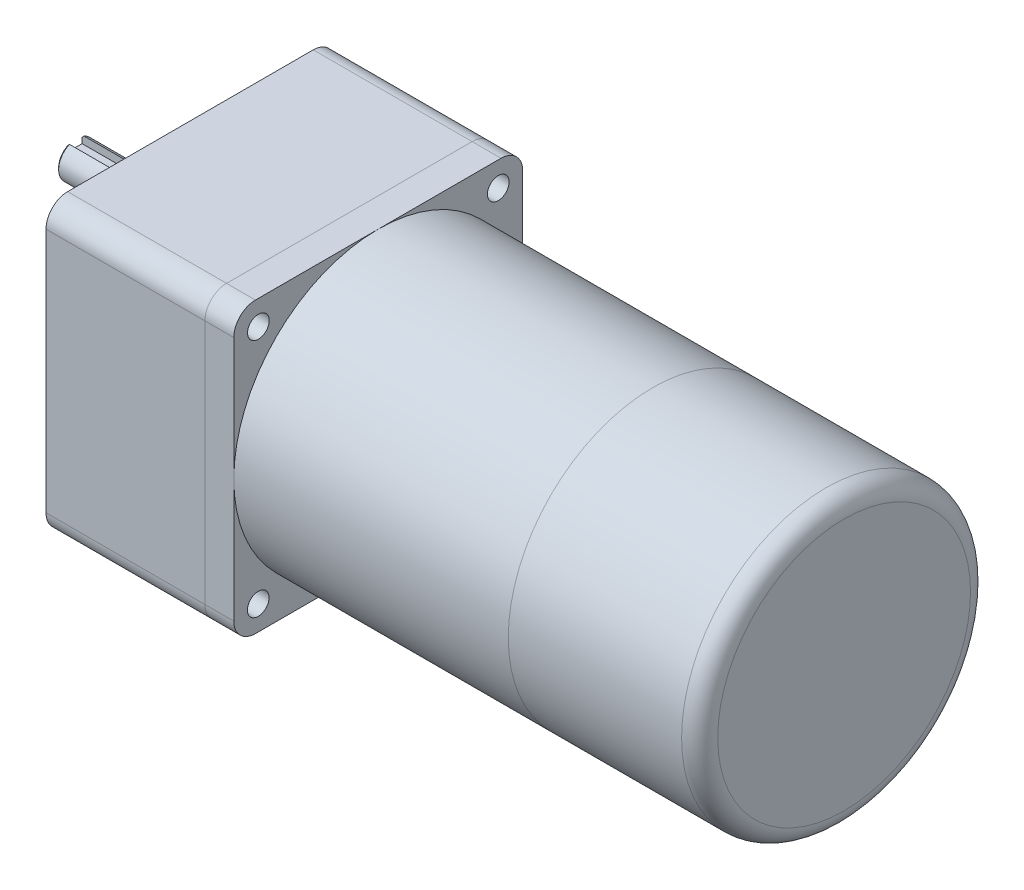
ISO-10303-21;
HEADER;
FILE_DESCRIPTION(('STEP AP214'),'2;1');
FILE_NAME('part.step','',(''),(''),'','','');
FILE_SCHEMA(('AUTOMOTIVE_DESIGN { 1 0 10303 214 1 1 1 1 }'));
ENDSEC;
DATA;
#1=APPLICATION_CONTEXT('core data for automotive mechanical design processes');
#2=APPLICATION_PROTOCOL_DEFINITION('international standard','automotive_design',2000,#1);
#3=PRODUCT_CONTEXT('',#1,'mechanical');
#4=PRODUCT('Part','Part','',(#3));
#5=PRODUCT_RELATED_PRODUCT_CATEGORY('part','',(#4));
#6=PRODUCT_DEFINITION_FORMATION('','',#4);
#7=PRODUCT_DEFINITION_CONTEXT('part definition',#1,'design');
#8=PRODUCT_DEFINITION('design','',#6,#7);
#9=PRODUCT_DEFINITION_SHAPE('','',#8);
#10=(LENGTH_UNIT() NAMED_UNIT(*) SI_UNIT(.MILLI.,.METRE.));
#11=(NAMED_UNIT(*) PLANE_ANGLE_UNIT() SI_UNIT($,.RADIAN.));
#12=(NAMED_UNIT(*) SI_UNIT($,.STERADIAN.) SOLID_ANGLE_UNIT());
#13=UNCERTAINTY_MEASURE_WITH_UNIT(LENGTH_MEASURE(1.E-05),#10,'distance_accuracy_value','');
#14=(GEOMETRIC_REPRESENTATION_CONTEXT(3) GLOBAL_UNCERTAINTY_ASSIGNED_CONTEXT((#13)) GLOBAL_UNIT_ASSIGNED_CONTEXT((#10,
#11,#12)) REPRESENTATION_CONTEXT('',''));
#15=CARTESIAN_POINT('',(0.,0.,0.));
#16=DIRECTION('',(0.,0.,1.));
#17=DIRECTION('',(1.,0.,0.));
#18=AXIS2_PLACEMENT_3D('',#15,#16,#17);
#19=CARTESIAN_POINT('',(-32.,15.,0.));
#20=DIRECTION('',(1.,0.,0.));
#21=DIRECTION('',(0.,0.,-1.));
#22=AXIS2_PLACEMENT_3D('',#19,#20,#21);
#23=CYLINDRICAL_SURFACE('',#22,5.);
#24=DIRECTION('',(1.,0.,0.));
#25=VECTOR('',#24,1.);
#26=CARTESIAN_POINT('',(-32.,19.5825756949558,2.));
#27=LINE('',#26,#25);
#28=CARTESIAN_POINT('',(-9.,19.5825756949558,2.));
#29=VERTEX_POINT('',#28);
#30=CARTESIAN_POINT('',(-31.5,19.5825756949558,2.));
#31=VERTEX_POINT('',#30);
#32=EDGE_CURVE('E131',#29,#31,#27,.F.);
#33=ORIENTED_EDGE('',*,*,#32,.T.);
#34=CARTESIAN_POINT('',(-31.5,15.,0.));
#35=DIRECTION('',(-1.,0.,0.));
#36=DIRECTION('',(0.,0.,1.));
#37=AXIS2_PLACEMENT_3D('',#34,#35,#36);
#38=CIRCLE('',#37,5.);
#39=CARTESIAN_POINT('',(-31.5,19.5825756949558,-2.));
#40=VERTEX_POINT('',#39);
#41=EDGE_CURVE('E59',#31,#40,#38,.F.);
#42=ORIENTED_EDGE('',*,*,#41,.T.);
#43=DIRECTION('',(1.,0.,0.));
#44=VECTOR('',#43,1.);
#45=CARTESIAN_POINT('',(-32.,19.5825756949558,-2.));
#46=LINE('',#45,#44);
#47=CARTESIAN_POINT('',(-9.,19.5825756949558,-2.));
#48=VERTEX_POINT('',#47);
#49=EDGE_CURVE('E126',#40,#48,#46,.T.);
#50=ORIENTED_EDGE('',*,*,#49,.T.);
#51=CARTESIAN_POINT('',(-9.,19.5825756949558,-2.));
#52=CARTESIAN_POINT('',(-8.94619414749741,19.5825646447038,-2.00000798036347));
#53=CARTESIAN_POINT('',(-8.89239433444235,19.5835230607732,-1.99782891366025));
#54=CARTESIAN_POINT('',(-8.7852287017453,19.5872962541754,-1.98915905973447));
#55=CARTESIAN_POINT('',(-8.73186272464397,19.5901103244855,-1.98266991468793));
#56=CARTESIAN_POINT('',(-8.62615317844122,19.5974978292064,-1.9654760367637));
#57=CARTESIAN_POINT('',(-8.57380641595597,19.6020643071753,-1.95478796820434));
#58=CARTESIAN_POINT('',(-8.47029922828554,19.6128005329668,-1.92931630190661));
#59=CARTESIAN_POINT('',(-8.41913887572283,19.618970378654,-1.91453245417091));
#60=CARTESIAN_POINT('',(-8.26806414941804,19.6395929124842,-1.86426971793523));
#61=CARTESIAN_POINT('',(-8.17034576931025,19.6561744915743,-1.82284489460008));
#62=CARTESIAN_POINT('',(-7.98320441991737,19.6931237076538,-1.72548191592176));
#63=CARTESIAN_POINT('',(-7.89378944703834,19.7134949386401,-1.66952996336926));
#64=CARTESIAN_POINT('',(-7.72073760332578,19.7570099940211,-1.54131835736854));
#65=CARTESIAN_POINT('',(-7.63763278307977,19.7802424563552,-1.4683691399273));
#66=CARTESIAN_POINT('',(-7.48445972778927,19.8261279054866,-1.30969646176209));
#67=CARTESIAN_POINT('',(-7.41439416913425,19.8487807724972,-1.22397038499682));
#68=CARTESIAN_POINT('',(-7.28659360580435,19.8920341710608,-1.03800590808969));
#69=CARTESIAN_POINT('',(-7.22945519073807,19.9125182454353,-0.937327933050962));
#70=CARTESIAN_POINT('',(-7.13315592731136,19.94803944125,-0.72682414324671));
#71=CARTESIAN_POINT('',(-7.09398757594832,19.9630788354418,-0.617002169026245));
#72=CARTESIAN_POINT('',(-7.03665879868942,19.9853831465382,-0.396967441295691));
#73=CARTESIAN_POINT('',(-7.01757304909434,19.9929892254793,-0.287031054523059));
#74=CARTESIAN_POINT('',(-6.99797152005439,20.0008031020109,-0.0652684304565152));
#75=CARTESIAN_POINT('',(-6.99744916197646,20.0010135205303,0.0465571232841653));
#76=CARTESIAN_POINT('',(-7.01448283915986,19.994219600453,0.262233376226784));
#77=CARTESIAN_POINT('',(-7.03102504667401,19.9876198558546,0.366179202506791));
#78=CARTESIAN_POINT('',(-7.07999342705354,19.9684927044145,0.569674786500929));
#79=CARTESIAN_POINT('',(-7.11242049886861,19.9559649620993,0.669224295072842));
#80=CARTESIAN_POINT('',(-7.19263629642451,19.9259683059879,0.862897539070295));
#81=CARTESIAN_POINT('',(-7.24064924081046,19.9084277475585,0.95691685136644));
#82=CARTESIAN_POINT('',(-7.35046458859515,19.8701460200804,1.13580746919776));
#83=CARTESIAN_POINT('',(-7.41227182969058,19.8494037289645,1.22067554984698));
#84=CARTESIAN_POINT('',(-7.55264418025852,19.8052178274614,1.38476339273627));
#85=CARTESIAN_POINT('',(-7.63204247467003,19.7816862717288,1.4632477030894));
#86=CARTESIAN_POINT('',(-7.80298009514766,19.7356195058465,1.60609926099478));
#87=CARTESIAN_POINT('',(-7.89452492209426,19.7130847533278,1.67046007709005));
#88=CARTESIAN_POINT('',(-8.09047028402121,19.6709568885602,1.78493657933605));
#89=CARTESIAN_POINT('',(-8.1951648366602,19.6514670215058,1.83458932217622));
#90=CARTESIAN_POINT('',(-8.41236152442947,19.6188610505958,1.91521298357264));
#91=CARTESIAN_POINT('',(-8.5248494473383,19.6057336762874,1.94621696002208));
#92=CARTESIAN_POINT('',(-8.69874363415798,19.5920830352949,1.9781058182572));
#93=CARTESIAN_POINT('',(-8.75865754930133,19.5885343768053,1.98630505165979));
#94=CARTESIAN_POINT('',(-8.87903501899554,19.5837754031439,1.99725282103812));
#95=CARTESIAN_POINT('',(-8.93949821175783,19.5825636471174,2.00000471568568));
#96=CARTESIAN_POINT('',(-9.,19.5825756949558,2.));
#97=B_SPLINE_CURVE_WITH_KNOTS('',3,(#51,#52,#53,#54,#55,#56,#57,#58,#59,#60,#61,#62,#63,#64,#65,
#66,#67,#68,#69,#70,#71,#72,#73,#74,#75,#76,#77,#78,#79,#80,#81,#82,#83,#84,#85,#86,#87,#88,#89,
#90,#91,#92,#93,#94,#95,#96),.UNSPECIFIED.,.F.,.F.,(4,2,2,2,2,2,2,2,2,2,2,2,2,2,2,2,2,2,2,2,2,2,
4),(0.,0.161354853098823,0.322648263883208,0.48330791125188,0.643977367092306,0.964683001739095,
1.28569434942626,1.62318047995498,1.96073580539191,2.31162858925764,2.66237473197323,
2.9961387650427,3.32978451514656,3.64468915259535,3.95961161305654,4.27928176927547,
4.59906421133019,4.93981874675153,5.28072813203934,5.63144241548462,5.98153315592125,
6.16300192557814,6.34435877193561),.UNSPECIFIED.);
#98=EDGE_CURVE('E105',#48,#29,#97,.T.);
#99=ORIENTED_EDGE('',*,*,#98,.T.);
#100=EDGE_LOOP('',(#33,#42,#50,#99));
#101=FACE_BOUND('',#100,.T.);
#102=CARTESIAN_POINT('',(-3.7,15.,0.));
#103=DIRECTION('',(-1.,0.,0.));
#104=DIRECTION('',(0.,0.,1.));
#105=AXIS2_PLACEMENT_3D('',#102,#103,#104);
#106=CIRCLE('',#105,5.);
#107=CARTESIAN_POINT('',(-3.7,15.,5.));
#108=VERTEX_POINT('',#107);
#109=EDGE_CURVE('E133',#108,#108,#106,.T.);
#110=ORIENTED_EDGE('',*,*,#109,.T.);
#111=EDGE_LOOP('',(#110));
#112=FACE_BOUND('',#111,.T.);
#113=ADVANCED_FACE('F46',(#101,#112),#23,.T.);
#114=CARTESIAN_POINT('',(-32.,15.,0.));
#115=DIRECTION('',(-1.,0.,0.));
#116=DIRECTION('',(0.,0.,1.));
#117=AXIS2_PLACEMENT_3D('',#114,#115,#116);
#118=PLANE('',#117);
#119=DIRECTION('',(0.,1.,0.));
#120=VECTOR('',#119,1.);
#121=CARTESIAN_POINT('',(-32.,17.5,-2.));
#122=LINE('',#121,#120);
#123=CARTESIAN_POINT('',(-32.,17.5,-2.));
#124=VERTEX_POINT('',#123);
#125=CARTESIAN_POINT('',(-32.,19.0311288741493,-2.));
#126=VERTEX_POINT('',#125);
#127=EDGE_CURVE('E107',#124,#126,#122,.T.);
#128=ORIENTED_EDGE('',*,*,#127,.T.);
#129=CARTESIAN_POINT('',(-32.,15.,0.));
#130=DIRECTION('',(-1.,0.,0.));
#131=DIRECTION('',(0.,0.,1.));
#132=AXIS2_PLACEMENT_3D('',#129,#130,#131);
#133=CIRCLE('',#132,4.50000000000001);
#134=CARTESIAN_POINT('',(-32.,19.0311288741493,2.));
#135=VERTEX_POINT('',#134);
#136=EDGE_CURVE('E141',#126,#135,#133,.T.);
#137=ORIENTED_EDGE('',*,*,#136,.T.);
#138=DIRECTION('',(0.,1.,0.));
#139=VECTOR('',#138,1.);
#140=CARTESIAN_POINT('',(-32.,17.5,2.));
#141=LINE('',#140,#139);
#142=CARTESIAN_POINT('',(-32.,17.5,2.));
#143=VERTEX_POINT('',#142);
#144=EDGE_CURVE('E127',#143,#135,#141,.T.);
#145=ORIENTED_EDGE('',*,*,#144,.F.);
#146=DIRECTION('',(0.,0.,1.));
#147=VECTOR('',#146,1.);
#148=CARTESIAN_POINT('',(-32.,17.5,-2.));
#149=LINE('',#148,#147);
#150=EDGE_CURVE('E116',#124,#143,#149,.T.);
#151=ORIENTED_EDGE('',*,*,#150,.F.);
#152=EDGE_LOOP('',(#128,#137,#145,#151));
#153=FACE_BOUND('',#152,.T.);
#154=ADVANCED_FACE('F152',(#153),#118,.T.);
#155=CARTESIAN_POINT('',(-3.7,15.,0.));
#156=DIRECTION('',(-1.,0.,0.));
#157=DIRECTION('',(0.,0.,1.));
#158=AXIS2_PLACEMENT_3D('',#155,#156,#157);
#159=PLANE('',#158);
#160=ORIENTED_EDGE('',*,*,#109,.F.);
#161=EDGE_LOOP('',(#160));
#162=FACE_BOUND('',#161,.T.);
#163=ADVANCED_FACE('F149',(#162),#159,.F.);
#164=CARTESIAN_POINT('',(-9.,17.5,0.));
#165=DIRECTION('',(0.,1.,0.));
#166=DIRECTION('',(0.,0.,1.));
#167=AXIS2_PLACEMENT_3D('',#164,#165,#166);
#168=CYLINDRICAL_SURFACE('',#167,2.);
#169=DIRECTION('',(0.,1.,0.));
#170=VECTOR('',#169,1.);
#171=CARTESIAN_POINT('',(-9.,17.5,-2.));
#172=LINE('',#171,#170);
#173=CARTESIAN_POINT('',(-9.,17.5,-2.));
#174=VERTEX_POINT('',#173);
#175=EDGE_CURVE('E97',#174,#48,#172,.T.);
#176=ORIENTED_EDGE('',*,*,#175,.F.);
#177=CARTESIAN_POINT('',(-9.,17.5,0.));
#178=DIRECTION('',(0.,1.,0.));
#179=DIRECTION('',(0.,0.,1.));
#180=AXIS2_PLACEMENT_3D('',#177,#178,#179);
#181=CIRCLE('',#180,2.);
#182=CARTESIAN_POINT('',(-9.,17.5,2.));
#183=VERTEX_POINT('',#182);
#184=EDGE_CURVE('E102',#183,#174,#181,.T.);
#185=ORIENTED_EDGE('',*,*,#184,.F.);
#186=DIRECTION('',(0.,1.,0.));
#187=VECTOR('',#186,1.);
#188=CARTESIAN_POINT('',(-9.,17.5,2.));
#189=LINE('',#188,#187);
#190=EDGE_CURVE('E124',#183,#29,#189,.T.);
#191=ORIENTED_EDGE('',*,*,#190,.T.);
#192=ORIENTED_EDGE('',*,*,#98,.F.);
#193=EDGE_LOOP('',(#176,#185,#191,#192));
#194=FACE_BOUND('',#193,.T.);
#195=ADVANCED_FACE('F99',(#194),#168,.F.);
#196=CARTESIAN_POINT('',(-32.,17.5,2.));
#197=DIRECTION('',(0.,0.,1.));
#198=DIRECTION('',(1.,0.,0.));
#199=AXIS2_PLACEMENT_3D('',#196,#197,#198);
#200=PLANE('',#199);
#201=ORIENTED_EDGE('',*,*,#144,.T.);
#202=CARTESIAN_POINT('',(-32.,19.0311288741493,2.));
#203=CARTESIAN_POINT('',(-31.9586097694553,19.0773327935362,2.));
#204=CARTESIAN_POINT('',(-31.9171421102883,19.1234672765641,2.));
#205=CARTESIAN_POINT('',(-31.8340649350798,19.2156076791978,2.));
#206=CARTESIAN_POINT('',(-31.7924554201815,19.2616135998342,2.));
#207=CARTESIAN_POINT('',(-31.7091069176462,19.3535078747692,2.));
#208=CARTESIAN_POINT('',(-31.6673679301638,19.3993962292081,2.));
#209=CARTESIAN_POINT('',(-31.5837706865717,19.4910648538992,2.));
#210=CARTESIAN_POINT('',(-31.5419124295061,19.5368451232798,2.));
#211=CARTESIAN_POINT('',(-31.5,19.5825756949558,2.));
#212=B_SPLINE_CURVE_WITH_KNOTS('',3,(#202,#203,#204,#205,#206,#207,#208,#209,#210,#211),
.UNSPECIFIED.,.F.,.F.,(4,2,2,2,4),(0.,0.186095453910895,0.372189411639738,0.558283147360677,
0.744378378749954),.UNSPECIFIED.);
#213=EDGE_CURVE('E73',#135,#31,#212,.T.);
#214=ORIENTED_EDGE('',*,*,#213,.T.);
#215=ORIENTED_EDGE('',*,*,#32,.F.);
#216=ORIENTED_EDGE('',*,*,#190,.F.);
#217=DIRECTION('',(1.,0.,0.));
#218=VECTOR('',#217,1.);
#219=CARTESIAN_POINT('',(-32.,17.5,2.));
#220=LINE('',#219,#218);
#221=EDGE_CURVE('E108',#143,#183,#220,.T.);
#222=ORIENTED_EDGE('',*,*,#221,.F.);
#223=EDGE_LOOP('',(#201,#214,#215,#216,#222));
#224=FACE_BOUND('',#223,.T.);
#225=ADVANCED_FACE('F148',(#224),#200,.F.);
#226=CARTESIAN_POINT('',(-9.,17.5,-2.));
#227=DIRECTION('',(0.,0.,-1.));
#228=DIRECTION('',(-1.,0.,0.));
#229=AXIS2_PLACEMENT_3D('',#226,#227,#228);
#230=PLANE('',#229);
#231=ORIENTED_EDGE('',*,*,#49,.F.);
#232=CARTESIAN_POINT('',(-31.5,19.5825756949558,-2.));
#233=CARTESIAN_POINT('',(-31.5419124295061,19.5368451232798,-2.));
#234=CARTESIAN_POINT('',(-31.5837706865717,19.4910648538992,-2.));
#235=CARTESIAN_POINT('',(-31.6673679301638,19.3993962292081,-2.));
#236=CARTESIAN_POINT('',(-31.7091069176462,19.3535078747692,-2.));
#237=CARTESIAN_POINT('',(-31.7924554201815,19.2616135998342,-2.));
#238=CARTESIAN_POINT('',(-31.8340649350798,19.2156076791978,-2.));
#239=CARTESIAN_POINT('',(-31.9171421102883,19.1234672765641,-2.));
#240=CARTESIAN_POINT('',(-31.9586097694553,19.0773327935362,-2.));
#241=CARTESIAN_POINT('',(-32.,19.0311288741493,-2.));
#242=B_SPLINE_CURVE_WITH_KNOTS('',3,(#232,#233,#234,#235,#236,#237,#238,#239,#240,#241),
.UNSPECIFIED.,.F.,.F.,(4,2,2,2,4),(0.,0.186095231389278,0.372188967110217,0.558282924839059,
0.744378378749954),.UNSPECIFIED.);
#243=EDGE_CURVE('E12',#40,#126,#242,.T.);
#244=ORIENTED_EDGE('',*,*,#243,.T.);
#245=ORIENTED_EDGE('',*,*,#127,.F.);
#246=DIRECTION('',(-1.,0.,0.));
#247=VECTOR('',#246,1.);
#248=CARTESIAN_POINT('',(-9.,17.5,-2.));
#249=LINE('',#248,#247);
#250=EDGE_CURVE('E111',#174,#124,#249,.T.);
#251=ORIENTED_EDGE('',*,*,#250,.F.);
#252=ORIENTED_EDGE('',*,*,#175,.T.);
#253=EDGE_LOOP('',(#231,#244,#245,#251,#252));
#254=FACE_BOUND('',#253,.T.);
#255=ADVANCED_FACE('F112',(#254),#230,.F.);
#256=CARTESIAN_POINT('',(-9.,17.5,0.));
#257=DIRECTION('',(0.,1.,0.));
#258=DIRECTION('',(0.,0.,1.));
#259=AXIS2_PLACEMENT_3D('',#256,#257,#258);
#260=PLANE('',#259);
#261=ORIENTED_EDGE('',*,*,#184,.T.);
#262=ORIENTED_EDGE('',*,*,#250,.T.);
#263=ORIENTED_EDGE('',*,*,#150,.T.);
#264=ORIENTED_EDGE('',*,*,#221,.T.);
#265=EDGE_LOOP('',(#261,#262,#263,#264));
#266=FACE_BOUND('',#265,.T.);
#267=ADVANCED_FACE('F118',(#266),#260,.T.);
#268=CARTESIAN_POINT('',(-32.,15.,0.));
#269=DIRECTION('',(1.,0.,0.));
#270=DIRECTION('',(0.,0.,-1.));
#271=AXIS2_PLACEMENT_3D('',#268,#269,#270);
#272=CONICAL_SURFACE('',#271,4.50000000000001,0.785398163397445);
#273=ORIENTED_EDGE('',*,*,#243,.F.);
#274=ORIENTED_EDGE('',*,*,#41,.F.);
#275=ORIENTED_EDGE('',*,*,#213,.F.);
#276=ORIENTED_EDGE('',*,*,#136,.F.);
#277=EDGE_LOOP('',(#273,#274,#275,#276));
#278=FACE_BOUND('',#277,.T.);
#279=ADVANCED_FACE('F48',(#278),#272,.T.);
#280=CLOSED_SHELL('',(#113,#154,#163,#195,#225,#255,#267,#279));
#281=MANIFOLD_SOLID_BREP('B2',#280);
#282=CARTESIAN_POINT('',(-3.7,15.,0.));
#283=DIRECTION('',(1.,0.,0.));
#284=DIRECTION('',(0.,0.,-1.));
#285=AXIS2_PLACEMENT_3D('',#282,#283,#284);
#286=CYLINDRICAL_SURFACE('',#285,15.);
#287=CARTESIAN_POINT('',(-3.2,15.,0.));
#288=DIRECTION('',(-1.,0.,0.));
#289=DIRECTION('',(0.,0.,1.));
#290=AXIS2_PLACEMENT_3D('',#287,#288,#289);
#291=CIRCLE('',#290,15.);
#292=CARTESIAN_POINT('',(-3.2,15.,15.));
#293=VERTEX_POINT('',#292);
#294=EDGE_CURVE('E45',#293,#293,#291,.F.);
#295=ORIENTED_EDGE('',*,*,#294,.T.);
#296=EDGE_LOOP('',(#295));
#297=FACE_BOUND('',#296,.T.);
#298=CARTESIAN_POINT('',(0.,15.,0.));
#299=DIRECTION('',(-1.,0.,0.));
#300=DIRECTION('',(0.,0.,1.));
#301=AXIS2_PLACEMENT_3D('',#298,#299,#300);
#302=CIRCLE('',#301,15.);
#303=CARTESIAN_POINT('',(0.,15.,15.));
#304=VERTEX_POINT('',#303);
#305=EDGE_CURVE('E245',#304,#304,#302,.T.);
#306=ORIENTED_EDGE('',*,*,#305,.T.);
#307=EDGE_LOOP('',(#306));
#308=FACE_BOUND('',#307,.T.);
#309=ADVANCED_FACE('F234',(#297,#308),#286,.T.);
#310=CARTESIAN_POINT('',(-3.7,15.,0.));
#311=DIRECTION('',(-1.,0.,0.));
#312=DIRECTION('',(0.,0.,1.));
#313=AXIS2_PLACEMENT_3D('',#310,#311,#312);
#314=PLANE('',#313);
#315=CARTESIAN_POINT('',(-3.7,15.,0.));
#316=DIRECTION('',(-1.,0.,0.));
#317=DIRECTION('',(0.,0.,1.));
#318=AXIS2_PLACEMENT_3D('',#315,#316,#317);
#319=CIRCLE('',#318,14.5);
#320=CARTESIAN_POINT('',(-3.7,15.,14.5));
#321=VERTEX_POINT('',#320);
#322=EDGE_CURVE('E241',#321,#321,#319,.T.);
#323=ORIENTED_EDGE('',*,*,#322,.T.);
#324=EDGE_LOOP('',(#323));
#325=FACE_BOUND('',#324,.T.);
#326=ADVANCED_FACE('F255',(#325),#314,.T.);
#327=CARTESIAN_POINT('',(0.,15.,0.));
#328=DIRECTION('',(-1.,0.,0.));
#329=DIRECTION('',(0.,0.,1.));
#330=AXIS2_PLACEMENT_3D('',#327,#328,#329);
#331=PLANE('',#330);
#332=ORIENTED_EDGE('',*,*,#305,.F.);
#333=EDGE_LOOP('',(#332));
#334=FACE_BOUND('',#333,.T.);
#335=ADVANCED_FACE('F253',(#334),#331,.F.);
#336=CARTESIAN_POINT('',(-3.2,15.,0.));
#337=DIRECTION('',(-1.,0.,0.));
#338=DIRECTION('',(0.,0.,1.));
#339=AXIS2_PLACEMENT_3D('',#336,#337,#338);
#340=TOROIDAL_SURFACE('',#339,14.5,0.5);
#341=ORIENTED_EDGE('',*,*,#294,.F.);
#342=EDGE_LOOP('',(#341));
#343=FACE_BOUND('',#342,.T.);
#344=ORIENTED_EDGE('',*,*,#322,.F.);
#345=EDGE_LOOP('',(#344));
#346=FACE_BOUND('',#345,.T.);
#347=ADVANCED_FACE('F236',(#343,#346),#340,.T.);
#348=CLOSED_SHELL('',(#309,#326,#335,#347));
#349=MANIFOLD_SOLID_BREP('B6',#348);
#350=CARTESIAN_POINT('',(181.,0.,0.));
#351=DIRECTION('',(-1.,0.,0.));
#352=DIRECTION('',(0.,0.,1.));
#353=AXIS2_PLACEMENT_3D('',#350,#351,#352);
#354=CYLINDRICAL_SURFACE('',#353,40.);
#355=CARTESIAN_POINT('',(176.,0.,0.));
#356=DIRECTION('',(1.,0.,0.));
#357=DIRECTION('',(0.,0.,-1.));
#358=AXIS2_PLACEMENT_3D('',#355,#356,#357);
#359=CIRCLE('',#358,40.);
#360=CARTESIAN_POINT('',(176.,0.,-40.));
#361=VERTEX_POINT('',#360);
#362=EDGE_CURVE('E233',#361,#361,#359,.F.);
#363=ORIENTED_EDGE('',*,*,#362,.T.);
#364=EDGE_LOOP('',(#363));
#365=FACE_BOUND('',#364,.T.);
#366=CARTESIAN_POINT('',(128.,0.,0.));
#367=DIRECTION('',(1.,0.,0.));
#368=DIRECTION('',(0.,0.,-1.));
#369=AXIS2_PLACEMENT_3D('',#366,#367,#368);
#370=CIRCLE('',#369,40.);
#371=CARTESIAN_POINT('',(128.,0.,-40.));
#372=VERTEX_POINT('',#371);
#373=EDGE_CURVE('E309',#372,#372,#370,.T.);
#374=ORIENTED_EDGE('',*,*,#373,.T.);
#375=EDGE_LOOP('',(#374));
#376=FACE_BOUND('',#375,.T.);
#377=ADVANCED_FACE('F298',(#365,#376),#354,.T.);
#378=CARTESIAN_POINT('',(181.,0.,0.));
#379=DIRECTION('',(1.,0.,0.));
#380=DIRECTION('',(0.,0.,-1.));
#381=AXIS2_PLACEMENT_3D('',#378,#379,#380);
#382=PLANE('',#381);
#383=CARTESIAN_POINT('',(181.,0.,0.));
#384=DIRECTION('',(1.,0.,0.));
#385=DIRECTION('',(0.,0.,-1.));
#386=AXIS2_PLACEMENT_3D('',#383,#384,#385);
#387=CIRCLE('',#386,35.);
#388=CARTESIAN_POINT('',(181.,0.,-35.));
#389=VERTEX_POINT('',#388);
#390=EDGE_CURVE('E305',#389,#389,#387,.T.);
#391=ORIENTED_EDGE('',*,*,#390,.T.);
#392=EDGE_LOOP('',(#391));
#393=FACE_BOUND('',#392,.T.);
#394=ADVANCED_FACE('F319',(#393),#382,.T.);
#395=CARTESIAN_POINT('',(128.,0.,0.));
#396=DIRECTION('',(1.,0.,0.));
#397=DIRECTION('',(0.,0.,-1.));
#398=AXIS2_PLACEMENT_3D('',#395,#396,#397);
#399=PLANE('',#398);
#400=ORIENTED_EDGE('',*,*,#373,.F.);
#401=EDGE_LOOP('',(#400));
#402=FACE_BOUND('',#401,.T.);
#403=ADVANCED_FACE('F317',(#402),#399,.F.);
#404=CARTESIAN_POINT('',(176.,0.,0.));
#405=DIRECTION('',(1.,0.,0.));
#406=DIRECTION('',(0.,0.,-1.));
#407=AXIS2_PLACEMENT_3D('',#404,#405,#406);
#408=TOROIDAL_SURFACE('',#407,35.,5.);
#409=ORIENTED_EDGE('',*,*,#362,.F.);
#410=EDGE_LOOP('',(#409));
#411=FACE_BOUND('',#410,.T.);
#412=ORIENTED_EDGE('',*,*,#390,.F.);
#413=EDGE_LOOP('',(#412));
#414=FACE_BOUND('',#413,.T.);
#415=ADVANCED_FACE('F300',(#411,#414),#408,.T.);
#416=CLOSED_SHELL('',(#377,#394,#403,#415));
#417=MANIFOLD_SOLID_BREP('B40',#416);
#418=CARTESIAN_POINT('',(128.,0.,0.));
#419=DIRECTION('',(-1.,0.,0.));
#420=DIRECTION('',(0.,0.,1.));
#421=AXIS2_PLACEMENT_3D('',#418,#419,#420);
#422=CYLINDRICAL_SURFACE('',#421,40.);
#423=CARTESIAN_POINT('',(128.,0.,0.));
#424=DIRECTION('',(1.,0.,0.));
#425=DIRECTION('',(0.,0.,-1.));
#426=AXIS2_PLACEMENT_3D('',#423,#424,#425);
#427=CIRCLE('',#426,40.);
#428=CARTESIAN_POINT('',(128.,0.,-40.));
#429=VERTEX_POINT('',#428);
#430=EDGE_CURVE('E297',#429,#429,#427,.T.);
#431=ORIENTED_EDGE('',*,*,#430,.F.);
#432=EDGE_LOOP('',(#431));
#433=FACE_BOUND('',#432,.T.);
#434=CARTESIAN_POINT('',(52.,0.,0.));
#435=DIRECTION('',(1.,0.,0.));
#436=DIRECTION('',(0.,0.,-1.));
#437=AXIS2_PLACEMENT_3D('',#434,#435,#436);
#438=CIRCLE('',#437,40.);
#439=CARTESIAN_POINT('',(52.,0.,-40.));
#440=VERTEX_POINT('',#439);
#441=EDGE_CURVE('E367',#440,#440,#438,.T.);
#442=ORIENTED_EDGE('',*,*,#441,.T.);
#443=EDGE_LOOP('',(#442));
#444=FACE_BOUND('',#443,.T.);
#445=ADVANCED_FACE('F364',(#433,#444),#422,.T.);
#446=CARTESIAN_POINT('',(128.,0.,0.));
#447=DIRECTION('',(1.,0.,0.));
#448=DIRECTION('',(0.,0.,-1.));
#449=AXIS2_PLACEMENT_3D('',#446,#447,#448);
#450=PLANE('',#449);
#451=ORIENTED_EDGE('',*,*,#430,.T.);
#452=EDGE_LOOP('',(#451));
#453=FACE_BOUND('',#452,.T.);
#454=ADVANCED_FACE('F379',(#453),#450,.T.);
#455=CARTESIAN_POINT('',(52.,0.,0.));
#456=DIRECTION('',(1.,0.,0.));
#457=DIRECTION('',(0.,0.,-1.));
#458=AXIS2_PLACEMENT_3D('',#455,#456,#457);
#459=PLANE('',#458);
#460=ORIENTED_EDGE('',*,*,#441,.F.);
#461=EDGE_LOOP('',(#460));
#462=FACE_BOUND('',#461,.T.);
#463=ADVANCED_FACE('F377',(#462),#459,.F.);
#464=CLOSED_SHELL('',(#445,#454,#463));
#465=MANIFOLD_SOLID_BREP('B228',#464);
#466=CARTESIAN_POINT('',(52.,-34.,34.));
#467=DIRECTION('',(-1.,0.,0.));
#468=DIRECTION('',(0.,0.,1.));
#469=AXIS2_PLACEMENT_3D('',#466,#467,#468);
#470=CYLINDRICAL_SURFACE('',#469,6.);
#471=CARTESIAN_POINT('',(44.,-34.,34.));
#472=DIRECTION('',(1.,0.,0.));
#473=DIRECTION('',(0.,0.,1.));
#474=AXIS2_PLACEMENT_3D('',#471,#472,#473);
#475=CIRCLE('',#474,6.);
#476=CARTESIAN_POINT('',(44.,-34.,40.));
#477=VERTEX_POINT('',#476);
#478=CARTESIAN_POINT('',(44.,-40.,34.));
#479=VERTEX_POINT('',#478);
#480=EDGE_CURVE('E512',#477,#479,#475,.T.);
#481=ORIENTED_EDGE('',*,*,#480,.T.);
#482=DIRECTION('',(-1.,0.,0.));
#483=VECTOR('',#482,1.);
#484=CARTESIAN_POINT('',(52.,-40.,34.));
#485=LINE('',#484,#483);
#486=CARTESIAN_POINT('',(52.,-40.,34.));
#487=VERTEX_POINT('',#486);
#488=EDGE_CURVE('E362',#487,#479,#485,.T.);
#489=ORIENTED_EDGE('',*,*,#488,.F.);
#490=CARTESIAN_POINT('',(52.,-34.,34.));
#491=DIRECTION('',(1.,0.,0.));
#492=DIRECTION('',(0.,0.,1.));
#493=AXIS2_PLACEMENT_3D('',#490,#491,#492);
#494=CIRCLE('',#493,6.);
#495=CARTESIAN_POINT('',(52.,-34.,40.));
#496=VERTEX_POINT('',#495);
#497=EDGE_CURVE('E526',#496,#487,#494,.T.);
#498=ORIENTED_EDGE('',*,*,#497,.F.);
#499=DIRECTION('',(-1.,0.,0.));
#500=VECTOR('',#499,1.);
#501=CARTESIAN_POINT('',(52.,-34.,40.));
#502=LINE('',#501,#500);
#503=EDGE_CURVE('E508',#496,#477,#502,.T.);
#504=ORIENTED_EDGE('',*,*,#503,.T.);
#505=EDGE_LOOP('',(#481,#489,#498,#504));
#506=FACE_BOUND('',#505,.T.);
#507=ADVANCED_FACE('F414',(#506),#470,.T.);
#508=CARTESIAN_POINT('',(52.,-40.,34.));
#509=DIRECTION('',(0.,1.,0.));
#510=DIRECTION('',(0.,0.,1.));
#511=AXIS2_PLACEMENT_3D('',#508,#509,#510);
#512=PLANE('',#511);
#513=DIRECTION('',(0.,0.,-1.));
#514=VECTOR('',#513,1.);
#515=CARTESIAN_POINT('',(44.,-40.,34.));
#516=LINE('',#515,#514);
#517=CARTESIAN_POINT('',(44.,-40.,-34.));
#518=VERTEX_POINT('',#517);
#519=EDGE_CURVE('E515',#479,#518,#516,.T.);
#520=ORIENTED_EDGE('',*,*,#519,.T.);
#521=DIRECTION('',(-1.,0.,0.));
#522=VECTOR('',#521,1.);
#523=CARTESIAN_POINT('',(52.,-40.,-34.));
#524=LINE('',#523,#522);
#525=CARTESIAN_POINT('',(52.,-40.,-34.));
#526=VERTEX_POINT('',#525);
#527=EDGE_CURVE('E423',#526,#518,#524,.T.);
#528=ORIENTED_EDGE('',*,*,#527,.F.);
#529=DIRECTION('',(0.,0.,-1.));
#530=VECTOR('',#529,1.);
#531=CARTESIAN_POINT('',(52.,-40.,34.));
#532=LINE('',#531,#530);
#533=EDGE_CURVE('E475',#487,#526,#532,.T.);
#534=ORIENTED_EDGE('',*,*,#533,.F.);
#535=ORIENTED_EDGE('',*,*,#488,.T.);
#536=EDGE_LOOP('',(#520,#528,#534,#535));
#537=FACE_BOUND('',#536,.T.);
#538=ADVANCED_FACE('F580',(#537),#512,.F.);
#539=CARTESIAN_POINT('',(52.,-34.,-34.));
#540=DIRECTION('',(-1.,0.,0.));
#541=DIRECTION('',(0.,0.,1.));
#542=AXIS2_PLACEMENT_3D('',#539,#540,#541);
#543=CYLINDRICAL_SURFACE('',#542,6.);
#544=CARTESIAN_POINT('',(44.,-34.,-34.));
#545=DIRECTION('',(1.,0.,0.));
#546=DIRECTION('',(0.,0.,-1.));
#547=AXIS2_PLACEMENT_3D('',#544,#545,#546);
#548=CIRCLE('',#547,6.);
#549=CARTESIAN_POINT('',(44.,-34.,-40.));
#550=VERTEX_POINT('',#549);
#551=EDGE_CURVE('E517',#518,#550,#548,.T.);
#552=ORIENTED_EDGE('',*,*,#551,.T.);
#553=DIRECTION('',(-1.,0.,0.));
#554=VECTOR('',#553,1.);
#555=CARTESIAN_POINT('',(52.,-34.,-40.));
#556=LINE('',#555,#554);
#557=CARTESIAN_POINT('',(52.,-34.,-40.));
#558=VERTEX_POINT('',#557);
#559=EDGE_CURVE('E533',#558,#550,#556,.T.);
#560=ORIENTED_EDGE('',*,*,#559,.F.);
#561=CARTESIAN_POINT('',(52.,-34.,-34.));
#562=DIRECTION('',(1.,0.,0.));
#563=DIRECTION('',(0.,0.,-1.));
#564=AXIS2_PLACEMENT_3D('',#561,#562,#563);
#565=CIRCLE('',#564,6.);
#566=EDGE_CURVE('E681',#526,#558,#565,.T.);
#567=ORIENTED_EDGE('',*,*,#566,.F.);
#568=ORIENTED_EDGE('',*,*,#527,.T.);
#569=EDGE_LOOP('',(#552,#560,#567,#568));
#570=FACE_BOUND('',#569,.T.);
#571=ADVANCED_FACE('F584',(#570),#543,.T.);
#572=CARTESIAN_POINT('',(52.,-34.,-40.));
#573=DIRECTION('',(0.,0.,1.));
#574=DIRECTION('',(1.,0.,0.));
#575=AXIS2_PLACEMENT_3D('',#572,#573,#574);
#576=PLANE('',#575);
#577=DIRECTION('',(0.,1.,0.));
#578=VECTOR('',#577,1.);
#579=CARTESIAN_POINT('',(44.,-34.,-40.));
#580=LINE('',#579,#578);
#581=CARTESIAN_POINT('',(44.,34.,-40.));
#582=VERTEX_POINT('',#581);
#583=EDGE_CURVE('E519',#550,#582,#580,.T.);
#584=ORIENTED_EDGE('',*,*,#583,.T.);
#585=DIRECTION('',(-1.,0.,0.));
#586=VECTOR('',#585,1.);
#587=CARTESIAN_POINT('',(52.,34.,-40.));
#588=LINE('',#587,#586);
#589=CARTESIAN_POINT('',(52.,34.,-40.));
#590=VERTEX_POINT('',#589);
#591=EDGE_CURVE('E530',#590,#582,#588,.T.);
#592=ORIENTED_EDGE('',*,*,#591,.F.);
#593=DIRECTION('',(0.,1.,0.));
#594=VECTOR('',#593,1.);
#595=CARTESIAN_POINT('',(52.,-34.,-40.));
#596=LINE('',#595,#594);
#597=EDGE_CURVE('E683',#558,#590,#596,.T.);
#598=ORIENTED_EDGE('',*,*,#597,.F.);
#599=ORIENTED_EDGE('',*,*,#559,.T.);
#600=EDGE_LOOP('',(#584,#592,#598,#599));
#601=FACE_BOUND('',#600,.T.);
#602=ADVANCED_FACE('F588',(#601),#576,.F.);
#603=CARTESIAN_POINT('',(52.,34.,-34.));
#604=DIRECTION('',(-1.,0.,0.));
#605=DIRECTION('',(0.,0.,1.));
#606=AXIS2_PLACEMENT_3D('',#603,#604,#605);
#607=CYLINDRICAL_SURFACE('',#606,6.);
#608=CARTESIAN_POINT('',(44.,34.,-34.));
#609=DIRECTION('',(1.,0.,0.));
#610=DIRECTION('',(0.,0.,1.));
#611=AXIS2_PLACEMENT_3D('',#608,#609,#610);
#612=CIRCLE('',#611,6.);
#613=CARTESIAN_POINT('',(44.,40.,-34.));
#614=VERTEX_POINT('',#613);
#615=EDGE_CURVE('E521',#582,#614,#612,.T.);
#616=ORIENTED_EDGE('',*,*,#615,.T.);
#617=DIRECTION('',(-1.,0.,0.));
#618=VECTOR('',#617,1.);
#619=CARTESIAN_POINT('',(52.,40.,-34.));
#620=LINE('',#619,#618);
#621=CARTESIAN_POINT('',(52.,40.,-34.));
#622=VERTEX_POINT('',#621);
#623=EDGE_CURVE('E503',#622,#614,#620,.T.);
#624=ORIENTED_EDGE('',*,*,#623,.F.);
#625=CARTESIAN_POINT('',(52.,34.,-34.));
#626=DIRECTION('',(1.,0.,0.));
#627=DIRECTION('',(0.,0.,1.));
#628=AXIS2_PLACEMENT_3D('',#625,#626,#627);
#629=CIRCLE('',#628,6.);
#630=EDGE_CURVE('E494',#590,#622,#629,.T.);
#631=ORIENTED_EDGE('',*,*,#630,.F.);
#632=ORIENTED_EDGE('',*,*,#591,.T.);
#633=EDGE_LOOP('',(#616,#624,#631,#632));
#634=FACE_BOUND('',#633,.T.);
#635=ADVANCED_FACE('F594',(#634),#607,.T.);
#636=CARTESIAN_POINT('',(52.,40.,34.));
#637=DIRECTION('',(0.,-1.,0.));
#638=DIRECTION('',(0.,0.,-1.));
#639=AXIS2_PLACEMENT_3D('',#636,#637,#638);
#640=PLANE('',#639);
#641=DIRECTION('',(0.,0.,1.));
#642=VECTOR('',#641,1.);
#643=CARTESIAN_POINT('',(44.,40.,34.));
#644=LINE('',#643,#642);
#645=CARTESIAN_POINT('',(44.,40.,34.));
#646=VERTEX_POINT('',#645);
#647=EDGE_CURVE('E502',#614,#646,#644,.T.);
#648=ORIENTED_EDGE('',*,*,#647,.T.);
#649=DIRECTION('',(-1.,0.,0.));
#650=VECTOR('',#649,1.);
#651=CARTESIAN_POINT('',(52.,40.,34.));
#652=LINE('',#651,#650);
#653=CARTESIAN_POINT('',(52.,40.,34.));
#654=VERTEX_POINT('',#653);
#655=EDGE_CURVE('E499',#654,#646,#652,.T.);
#656=ORIENTED_EDGE('',*,*,#655,.F.);
#657=DIRECTION('',(0.,0.,1.));
#658=VECTOR('',#657,1.);
#659=CARTESIAN_POINT('',(52.,40.,34.));
#660=LINE('',#659,#658);
#661=EDGE_CURVE('E488',#622,#654,#660,.T.);
#662=ORIENTED_EDGE('',*,*,#661,.F.);
#663=ORIENTED_EDGE('',*,*,#623,.T.);
#664=EDGE_LOOP('',(#648,#656,#662,#663));
#665=FACE_BOUND('',#664,.T.);
#666=ADVANCED_FACE('F500',(#665),#640,.F.);
#667=CARTESIAN_POINT('',(52.,34.,34.));
#668=DIRECTION('',(-1.,0.,0.));
#669=DIRECTION('',(0.,0.,1.));
#670=AXIS2_PLACEMENT_3D('',#667,#668,#669);
#671=CYLINDRICAL_SURFACE('',#670,6.);
#672=CARTESIAN_POINT('',(44.,34.,34.));
#673=DIRECTION('',(1.,0.,0.));
#674=DIRECTION('',(0.,0.,1.));
#675=AXIS2_PLACEMENT_3D('',#672,#673,#674);
#676=CIRCLE('',#675,6.);
#677=CARTESIAN_POINT('',(44.,34.,40.));
#678=VERTEX_POINT('',#677);
#679=EDGE_CURVE('E461',#646,#678,#676,.T.);
#680=ORIENTED_EDGE('',*,*,#679,.T.);
#681=DIRECTION('',(-1.,0.,0.));
#682=VECTOR('',#681,1.);
#683=CARTESIAN_POINT('',(52.,34.,40.));
#684=LINE('',#683,#682);
#685=CARTESIAN_POINT('',(52.,34.,40.));
#686=VERTEX_POINT('',#685);
#687=EDGE_CURVE('E504',#686,#678,#684,.T.);
#688=ORIENTED_EDGE('',*,*,#687,.F.);
#689=CARTESIAN_POINT('',(52.,34.,34.));
#690=DIRECTION('',(1.,0.,0.));
#691=DIRECTION('',(0.,0.,1.));
#692=AXIS2_PLACEMENT_3D('',#689,#690,#691);
#693=CIRCLE('',#692,6.);
#694=EDGE_CURVE('E492',#654,#686,#693,.T.);
#695=ORIENTED_EDGE('',*,*,#694,.F.);
#696=ORIENTED_EDGE('',*,*,#655,.T.);
#697=EDGE_LOOP('',(#680,#688,#695,#696));
#698=FACE_BOUND('',#697,.T.);
#699=ADVANCED_FACE('F506',(#698),#671,.T.);
#700=CARTESIAN_POINT('',(52.,-34.,40.));
#701=DIRECTION('',(0.,0.,-1.));
#702=DIRECTION('',(-1.,0.,0.));
#703=AXIS2_PLACEMENT_3D('',#700,#701,#702);
#704=PLANE('',#703);
#705=DIRECTION('',(0.,-1.,0.));
#706=VECTOR('',#705,1.);
#707=CARTESIAN_POINT('',(44.,-34.,40.));
#708=LINE('',#707,#706);
#709=EDGE_CURVE('E467',#678,#477,#708,.T.);
#710=ORIENTED_EDGE('',*,*,#709,.T.);
#711=ORIENTED_EDGE('',*,*,#503,.F.);
#712=DIRECTION('',(0.,-1.,0.));
#713=VECTOR('',#712,1.);
#714=CARTESIAN_POINT('',(52.,-34.,40.));
#715=LINE('',#714,#713);
#716=EDGE_CURVE('E432',#686,#496,#715,.T.);
#717=ORIENTED_EDGE('',*,*,#716,.F.);
#718=ORIENTED_EDGE('',*,*,#687,.T.);
#719=EDGE_LOOP('',(#710,#711,#717,#718));
#720=FACE_BOUND('',#719,.T.);
#721=ADVANCED_FACE('F569',(#720),#704,.F.);
#722=CARTESIAN_POINT('',(52.,-34.,34.));
#723=DIRECTION('',(-1.,0.,0.));
#724=DIRECTION('',(0.,0.,1.));
#725=AXIS2_PLACEMENT_3D('',#722,#723,#724);
#726=PLANE('',#725);
#727=CARTESIAN_POINT('',(52.,33.1906810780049,33.1906810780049));
#728=DIRECTION('',(1.,0.,0.));
#729=DIRECTION('',(0.,0.,-1.));
#730=AXIS2_PLACEMENT_3D('',#727,#728,#729);
#731=CIRCLE('',#730,3.);
#732=CARTESIAN_POINT('',(52.,33.1906810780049,30.1906810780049));
#733=VERTEX_POINT('',#732);
#734=EDGE_CURVE('E542',#733,#733,#731,.T.);
#735=ORIENTED_EDGE('',*,*,#734,.F.);
#736=EDGE_LOOP('',(#735));
#737=FACE_BOUND('',#736,.T.);
#738=CARTESIAN_POINT('',(52.,33.2340187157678,-33.2340187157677));
#739=DIRECTION('',(1.,0.,0.));
#740=DIRECTION('',(0.,0.,-1.));
#741=AXIS2_PLACEMENT_3D('',#738,#739,#740);
#742=CIRCLE('',#741,3.);
#743=CARTESIAN_POINT('',(52.,33.2340187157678,-36.2340187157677));
#744=VERTEX_POINT('',#743);
#745=EDGE_CURVE('E667',#744,#744,#742,.T.);
#746=ORIENTED_EDGE('',*,*,#745,.F.);
#747=EDGE_LOOP('',(#746));
#748=FACE_BOUND('',#747,.T.);
#749=CARTESIAN_POINT('',(52.,-33.2340187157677,-33.2340187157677));
#750=DIRECTION('',(1.,0.,0.));
#751=DIRECTION('',(0.,0.,-1.));
#752=AXIS2_PLACEMENT_3D('',#749,#750,#751);
#753=CIRCLE('',#752,3.);
#754=CARTESIAN_POINT('',(52.,-33.2340187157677,-36.2340187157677));
#755=VERTEX_POINT('',#754);
#756=EDGE_CURVE('E669',#755,#755,#753,.T.);
#757=ORIENTED_EDGE('',*,*,#756,.F.);
#758=EDGE_LOOP('',(#757));
#759=FACE_BOUND('',#758,.T.);
#760=CARTESIAN_POINT('',(52.,-33.2340187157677,33.2340187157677));
#761=DIRECTION('',(1.,0.,0.));
#762=DIRECTION('',(0.,0.,-1.));
#763=AXIS2_PLACEMENT_3D('',#760,#761,#762);
#764=CIRCLE('',#763,3.);
#765=CARTESIAN_POINT('',(52.,-33.2340187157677,30.2340187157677));
#766=VERTEX_POINT('',#765);
#767=EDGE_CURVE('E674',#766,#766,#764,.T.);
#768=ORIENTED_EDGE('',*,*,#767,.F.);
#769=EDGE_LOOP('',(#768));
#770=FACE_BOUND('',#769,.T.);
#771=ORIENTED_EDGE('',*,*,#497,.T.);
#772=ORIENTED_EDGE('',*,*,#533,.T.);
#773=ORIENTED_EDGE('',*,*,#566,.T.);
#774=ORIENTED_EDGE('',*,*,#597,.T.);
#775=ORIENTED_EDGE('',*,*,#630,.T.);
#776=ORIENTED_EDGE('',*,*,#661,.T.);
#777=ORIENTED_EDGE('',*,*,#694,.T.);
#778=ORIENTED_EDGE('',*,*,#716,.T.);
#779=EDGE_LOOP('',(#771,#772,#773,#774,#775,#776,#777,#778));
#780=FACE_BOUND('',#779,.T.);
#781=ADVANCED_FACE('F490',(#737,#748,#759,#770,#780),#726,.F.);
#782=CARTESIAN_POINT('',(44.,-34.,34.));
#783=DIRECTION('',(-1.,0.,0.));
#784=DIRECTION('',(0.,0.,1.));
#785=AXIS2_PLACEMENT_3D('',#782,#783,#784);
#786=PLANE('',#785);
#787=CARTESIAN_POINT('',(44.,33.1906810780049,33.1906810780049));
#788=DIRECTION('',(-1.,0.,0.));
#789=DIRECTION('',(0.,0.,1.));
#790=AXIS2_PLACEMENT_3D('',#787,#788,#789);
#791=CIRCLE('',#790,3.);
#792=CARTESIAN_POINT('',(44.,33.1906810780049,30.1906810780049));
#793=VERTEX_POINT('',#792);
#794=EDGE_CURVE('E417',#793,#793,#791,.T.);
#795=ORIENTED_EDGE('',*,*,#794,.F.);
#796=EDGE_LOOP('',(#795));
#797=FACE_BOUND('',#796,.T.);
#798=CARTESIAN_POINT('',(44.,33.2340187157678,-33.2340187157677));
#799=DIRECTION('',(-1.,0.,0.));
#800=DIRECTION('',(0.,0.,1.));
#801=AXIS2_PLACEMENT_3D('',#798,#799,#800);
#802=CIRCLE('',#801,3.);
#803=CARTESIAN_POINT('',(44.,33.2340187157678,-36.2340187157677));
#804=VERTEX_POINT('',#803);
#805=EDGE_CURVE('E544',#804,#804,#802,.T.);
#806=ORIENTED_EDGE('',*,*,#805,.F.);
#807=EDGE_LOOP('',(#806));
#808=FACE_BOUND('',#807,.T.);
#809=CARTESIAN_POINT('',(44.,-33.2340187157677,-33.2340187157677));
#810=DIRECTION('',(-1.,0.,0.));
#811=DIRECTION('',(0.,0.,1.));
#812=AXIS2_PLACEMENT_3D('',#809,#810,#811);
#813=CIRCLE('',#812,3.);
#814=CARTESIAN_POINT('',(44.,-33.2340187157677,-36.2340187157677));
#815=VERTEX_POINT('',#814);
#816=EDGE_CURVE('E541',#815,#815,#813,.T.);
#817=ORIENTED_EDGE('',*,*,#816,.F.);
#818=EDGE_LOOP('',(#817));
#819=FACE_BOUND('',#818,.T.);
#820=CARTESIAN_POINT('',(44.,-33.2340187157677,33.2340187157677));
#821=DIRECTION('',(-1.,0.,0.));
#822=DIRECTION('',(0.,0.,1.));
#823=AXIS2_PLACEMENT_3D('',#820,#821,#822);
#824=CIRCLE('',#823,3.);
#825=CARTESIAN_POINT('',(44.,-33.2340187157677,30.2340187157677));
#826=VERTEX_POINT('',#825);
#827=EDGE_CURVE('E538',#826,#826,#824,.T.);
#828=ORIENTED_EDGE('',*,*,#827,.F.);
#829=EDGE_LOOP('',(#828));
#830=FACE_BOUND('',#829,.T.);
#831=ORIENTED_EDGE('',*,*,#480,.F.);
#832=ORIENTED_EDGE('',*,*,#709,.F.);
#833=ORIENTED_EDGE('',*,*,#679,.F.);
#834=ORIENTED_EDGE('',*,*,#647,.F.);
#835=ORIENTED_EDGE('',*,*,#615,.F.);
#836=ORIENTED_EDGE('',*,*,#583,.F.);
#837=ORIENTED_EDGE('',*,*,#551,.F.);
#838=ORIENTED_EDGE('',*,*,#519,.F.);
#839=EDGE_LOOP('',(#831,#832,#833,#834,#835,#836,#837,#838));
#840=FACE_BOUND('',#839,.T.);
#841=ADVANCED_FACE('F554',(#797,#808,#819,#830,#840),#786,.T.);
#842=CARTESIAN_POINT('',(26.,-33.2340187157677,33.2340187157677));
#843=DIRECTION('',(1.,0.,0.));
#844=DIRECTION('',(0.,0.,-1.));
#845=AXIS2_PLACEMENT_3D('',#842,#843,#844);
#846=CYLINDRICAL_SURFACE('',#845,3.);
#847=CARTESIAN_POINT('',(44.,-33.2340187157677,30.2340187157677));
#848=CARTESIAN_POINT('',(44.0833333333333,-33.2340187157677,30.2340187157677));
#849=CARTESIAN_POINT('',(44.1666666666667,-33.2340187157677,30.2340187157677));
#850=CARTESIAN_POINT('',(44.3333333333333,-33.2340187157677,30.2340187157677));
#851=CARTESIAN_POINT('',(44.4166666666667,-33.2340187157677,30.2340187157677));
#852=CARTESIAN_POINT('',(44.5833333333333,-33.2340187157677,30.2340187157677));
#853=CARTESIAN_POINT('',(44.6666666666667,-33.2340187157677,30.2340187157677));
#854=CARTESIAN_POINT('',(44.8333333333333,-33.2340187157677,30.2340187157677));
#855=CARTESIAN_POINT('',(44.9166666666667,-33.2340187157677,30.2340187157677));
#856=CARTESIAN_POINT('',(45.0833333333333,-33.2340187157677,30.2340187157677));
#857=CARTESIAN_POINT('',(45.1666666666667,-33.2340187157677,30.2340187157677));
#858=CARTESIAN_POINT('',(45.3333333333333,-33.2340187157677,30.2340187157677));
#859=CARTESIAN_POINT('',(45.4166666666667,-33.2340187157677,30.2340187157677));
#860=CARTESIAN_POINT('',(45.5833333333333,-33.2340187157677,30.2340187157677));
#861=CARTESIAN_POINT('',(45.6666666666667,-33.2340187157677,30.2340187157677));
#862=CARTESIAN_POINT('',(45.8333333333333,-33.2340187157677,30.2340187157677));
#863=CARTESIAN_POINT('',(45.9166666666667,-33.2340187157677,30.2340187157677));
#864=CARTESIAN_POINT('',(46.0833333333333,-33.2340187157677,30.2340187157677));
#865=CARTESIAN_POINT('',(46.1666666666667,-33.2340187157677,30.2340187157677));
#866=CARTESIAN_POINT('',(46.3333333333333,-33.2340187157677,30.2340187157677));
#867=CARTESIAN_POINT('',(46.4166666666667,-33.2340187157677,30.2340187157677));
#868=CARTESIAN_POINT('',(46.5833333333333,-33.2340187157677,30.2340187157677));
#869=CARTESIAN_POINT('',(46.6666666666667,-33.2340187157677,30.2340187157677));
#870=CARTESIAN_POINT('',(46.8333333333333,-33.2340187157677,30.2340187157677));
#871=CARTESIAN_POINT('',(46.9166666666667,-33.2340187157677,30.2340187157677));
#872=CARTESIAN_POINT('',(47.0833333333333,-33.2340187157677,30.2340187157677));
#873=CARTESIAN_POINT('',(47.1666666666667,-33.2340187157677,30.2340187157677));
#874=CARTESIAN_POINT('',(47.3333333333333,-33.2340187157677,30.2340187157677));
#875=CARTESIAN_POINT('',(47.4166666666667,-33.2340187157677,30.2340187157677));
#876=CARTESIAN_POINT('',(47.5833333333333,-33.2340187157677,30.2340187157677));
#877=CARTESIAN_POINT('',(47.6666666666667,-33.2340187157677,30.2340187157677));
#878=CARTESIAN_POINT('',(47.8333333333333,-33.2340187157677,30.2340187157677));
#879=CARTESIAN_POINT('',(47.9166666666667,-33.2340187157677,30.2340187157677));
#880=CARTESIAN_POINT('',(48.0833333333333,-33.2340187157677,30.2340187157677));
#881=CARTESIAN_POINT('',(48.1666666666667,-33.2340187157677,30.2340187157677));
#882=CARTESIAN_POINT('',(48.3333333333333,-33.2340187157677,30.2340187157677));
#883=CARTESIAN_POINT('',(48.4166666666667,-33.2340187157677,30.2340187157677));
#884=CARTESIAN_POINT('',(48.5833333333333,-33.2340187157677,30.2340187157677));
#885=CARTESIAN_POINT('',(48.6666666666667,-33.2340187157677,30.2340187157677));
#886=CARTESIAN_POINT('',(48.8333333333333,-33.2340187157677,30.2340187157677));
#887=CARTESIAN_POINT('',(48.9166666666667,-33.2340187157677,30.2340187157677));
#888=CARTESIAN_POINT('',(49.0833333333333,-33.2340187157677,30.2340187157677));
#889=CARTESIAN_POINT('',(49.1666666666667,-33.2340187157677,30.2340187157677));
#890=CARTESIAN_POINT('',(49.3333333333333,-33.2340187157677,30.2340187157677));
#891=CARTESIAN_POINT('',(49.4166666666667,-33.2340187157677,30.2340187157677));
#892=CARTESIAN_POINT('',(49.5833333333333,-33.2340187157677,30.2340187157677));
#893=CARTESIAN_POINT('',(49.6666666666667,-33.2340187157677,30.2340187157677));
#894=CARTESIAN_POINT('',(49.8333333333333,-33.2340187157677,30.2340187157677));
#895=CARTESIAN_POINT('',(49.9166666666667,-33.2340187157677,30.2340187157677));
#896=CARTESIAN_POINT('',(50.0833333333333,-33.2340187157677,30.2340187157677));
#897=CARTESIAN_POINT('',(50.1666666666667,-33.2340187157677,30.2340187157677));
#898=CARTESIAN_POINT('',(50.3333333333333,-33.2340187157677,30.2340187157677));
#899=CARTESIAN_POINT('',(50.4166666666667,-33.2340187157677,30.2340187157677));
#900=CARTESIAN_POINT('',(50.5833333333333,-33.2340187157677,30.2340187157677));
#901=CARTESIAN_POINT('',(50.6666666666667,-33.2340187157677,30.2340187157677));
#902=CARTESIAN_POINT('',(50.8333333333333,-33.2340187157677,30.2340187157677));
#903=CARTESIAN_POINT('',(50.9166666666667,-33.2340187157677,30.2340187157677));
#904=CARTESIAN_POINT('',(51.0833333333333,-33.2340187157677,30.2340187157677));
#905=CARTESIAN_POINT('',(51.1666666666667,-33.2340187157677,30.2340187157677));
#906=CARTESIAN_POINT('',(51.3333333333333,-33.2340187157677,30.2340187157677));
#907=CARTESIAN_POINT('',(51.4166666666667,-33.2340187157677,30.2340187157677));
#908=CARTESIAN_POINT('',(51.5833333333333,-33.2340187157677,30.2340187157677));
#909=CARTESIAN_POINT('',(51.6666666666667,-33.2340187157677,30.2340187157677));
#910=CARTESIAN_POINT('',(51.8333333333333,-33.2340187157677,30.2340187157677));
#911=CARTESIAN_POINT('',(51.9166666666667,-33.2340187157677,30.2340187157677));
#912=CARTESIAN_POINT('',(52.,-33.2340187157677,30.2340187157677));
#913=B_SPLINE_CURVE_WITH_KNOTS('',3,(#847,#848,#849,#850,#851,#852,#853,#854,#855,#856,#857,
#858,#859,#860,#861,#862,#863,#864,#865,#866,#867,#868,#869,#870,#871,#872,#873,#874,#875,#876,
#877,#878,#879,#880,#881,#882,#883,#884,#885,#886,#887,#888,#889,#890,#891,#892,#893,#894,#895,
#896,#897,#898,#899,#900,#901,#902,#903,#904,#905,#906,#907,#908,#909,#910,#911,#912),
.UNSPECIFIED.,.F.,.F.,(4,2,2,2,2,2,2,2,2,2,2,2,2,2,2,2,2,2,2,2,2,2,2,2,2,2,2,2,2,2,2,2,4),(0.,
0.25,0.5,0.750000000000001,1.,1.24999999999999,1.49999999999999,1.74999999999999,
1.99999999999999,2.25,2.5,2.75,3.,3.25,3.5,3.75,4.,4.25,4.5,4.75,5.,5.25,5.5,5.75,6.,6.25,6.5,
6.74999999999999,6.99999999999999,7.24999999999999,7.49999999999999,7.74999999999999,
7.99999999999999),.UNSPECIFIED.);
#914=EDGE_CURVE('BSEAM557',#826,#766,#913,.T.);
#915=ORIENTED_EDGE('',*,*,#827,.T.);
#916=ORIENTED_EDGE('',*,*,#767,.T.);
#917=ORIENTED_EDGE('',*,*,#914,.T.);
#918=ORIENTED_EDGE('',*,*,#914,.F.);
#919=EDGE_LOOP('',(#915,#917,#916,#918));
#920=FACE_BOUND('',#919,.T.);
#921=ADVANCED_FACE('F557',(#920),#846,.F.);
#922=CARTESIAN_POINT('',(26.,-33.2340187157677,-33.2340187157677));
#923=DIRECTION('',(1.,0.,0.));
#924=DIRECTION('',(0.,0.,-1.));
#925=AXIS2_PLACEMENT_3D('',#922,#923,#924);
#926=CYLINDRICAL_SURFACE('',#925,3.);
#927=CARTESIAN_POINT('',(44.,-33.2340187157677,-36.2340187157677));
#928=CARTESIAN_POINT('',(44.0833333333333,-33.2340187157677,-36.2340187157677));
#929=CARTESIAN_POINT('',(44.1666666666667,-33.2340187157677,-36.2340187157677));
#930=CARTESIAN_POINT('',(44.3333333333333,-33.2340187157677,-36.2340187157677));
#931=CARTESIAN_POINT('',(44.4166666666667,-33.2340187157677,-36.2340187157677));
#932=CARTESIAN_POINT('',(44.5833333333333,-33.2340187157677,-36.2340187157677));
#933=CARTESIAN_POINT('',(44.6666666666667,-33.2340187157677,-36.2340187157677));
#934=CARTESIAN_POINT('',(44.8333333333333,-33.2340187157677,-36.2340187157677));
#935=CARTESIAN_POINT('',(44.9166666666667,-33.2340187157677,-36.2340187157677));
#936=CARTESIAN_POINT('',(45.0833333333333,-33.2340187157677,-36.2340187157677));
#937=CARTESIAN_POINT('',(45.1666666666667,-33.2340187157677,-36.2340187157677));
#938=CARTESIAN_POINT('',(45.3333333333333,-33.2340187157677,-36.2340187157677));
#939=CARTESIAN_POINT('',(45.4166666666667,-33.2340187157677,-36.2340187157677));
#940=CARTESIAN_POINT('',(45.5833333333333,-33.2340187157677,-36.2340187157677));
#941=CARTESIAN_POINT('',(45.6666666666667,-33.2340187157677,-36.2340187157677));
#942=CARTESIAN_POINT('',(45.8333333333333,-33.2340187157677,-36.2340187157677));
#943=CARTESIAN_POINT('',(45.9166666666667,-33.2340187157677,-36.2340187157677));
#944=CARTESIAN_POINT('',(46.0833333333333,-33.2340187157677,-36.2340187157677));
#945=CARTESIAN_POINT('',(46.1666666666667,-33.2340187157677,-36.2340187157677));
#946=CARTESIAN_POINT('',(46.3333333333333,-33.2340187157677,-36.2340187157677));
#947=CARTESIAN_POINT('',(46.4166666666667,-33.2340187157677,-36.2340187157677));
#948=CARTESIAN_POINT('',(46.5833333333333,-33.2340187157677,-36.2340187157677));
#949=CARTESIAN_POINT('',(46.6666666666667,-33.2340187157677,-36.2340187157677));
#950=CARTESIAN_POINT('',(46.8333333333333,-33.2340187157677,-36.2340187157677));
#951=CARTESIAN_POINT('',(46.9166666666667,-33.2340187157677,-36.2340187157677));
#952=CARTESIAN_POINT('',(47.0833333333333,-33.2340187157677,-36.2340187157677));
#953=CARTESIAN_POINT('',(47.1666666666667,-33.2340187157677,-36.2340187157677));
#954=CARTESIAN_POINT('',(47.3333333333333,-33.2340187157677,-36.2340187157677));
#955=CARTESIAN_POINT('',(47.4166666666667,-33.2340187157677,-36.2340187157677));
#956=CARTESIAN_POINT('',(47.5833333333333,-33.2340187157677,-36.2340187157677));
#957=CARTESIAN_POINT('',(47.6666666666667,-33.2340187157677,-36.2340187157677));
#958=CARTESIAN_POINT('',(47.8333333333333,-33.2340187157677,-36.2340187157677));
#959=CARTESIAN_POINT('',(47.9166666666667,-33.2340187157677,-36.2340187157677));
#960=CARTESIAN_POINT('',(48.0833333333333,-33.2340187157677,-36.2340187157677));
#961=CARTESIAN_POINT('',(48.1666666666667,-33.2340187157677,-36.2340187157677));
#962=CARTESIAN_POINT('',(48.3333333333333,-33.2340187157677,-36.2340187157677));
#963=CARTESIAN_POINT('',(48.4166666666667,-33.2340187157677,-36.2340187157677));
#964=CARTESIAN_POINT('',(48.5833333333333,-33.2340187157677,-36.2340187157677));
#965=CARTESIAN_POINT('',(48.6666666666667,-33.2340187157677,-36.2340187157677));
#966=CARTESIAN_POINT('',(48.8333333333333,-33.2340187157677,-36.2340187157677));
#967=CARTESIAN_POINT('',(48.9166666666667,-33.2340187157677,-36.2340187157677));
#968=CARTESIAN_POINT('',(49.0833333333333,-33.2340187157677,-36.2340187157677));
#969=CARTESIAN_POINT('',(49.1666666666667,-33.2340187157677,-36.2340187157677));
#970=CARTESIAN_POINT('',(49.3333333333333,-33.2340187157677,-36.2340187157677));
#971=CARTESIAN_POINT('',(49.4166666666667,-33.2340187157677,-36.2340187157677));
#972=CARTESIAN_POINT('',(49.5833333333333,-33.2340187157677,-36.2340187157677));
#973=CARTESIAN_POINT('',(49.6666666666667,-33.2340187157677,-36.2340187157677));
#974=CARTESIAN_POINT('',(49.8333333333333,-33.2340187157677,-36.2340187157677));
#975=CARTESIAN_POINT('',(49.9166666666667,-33.2340187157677,-36.2340187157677));
#976=CARTESIAN_POINT('',(50.0833333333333,-33.2340187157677,-36.2340187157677));
#977=CARTESIAN_POINT('',(50.1666666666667,-33.2340187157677,-36.2340187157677));
#978=CARTESIAN_POINT('',(50.3333333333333,-33.2340187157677,-36.2340187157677));
#979=CARTESIAN_POINT('',(50.4166666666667,-33.2340187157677,-36.2340187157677));
#980=CARTESIAN_POINT('',(50.5833333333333,-33.2340187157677,-36.2340187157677));
#981=CARTESIAN_POINT('',(50.6666666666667,-33.2340187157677,-36.2340187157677));
#982=CARTESIAN_POINT('',(50.8333333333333,-33.2340187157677,-36.2340187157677));
#983=CARTESIAN_POINT('',(50.9166666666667,-33.2340187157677,-36.2340187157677));
#984=CARTESIAN_POINT('',(51.0833333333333,-33.2340187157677,-36.2340187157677));
#985=CARTESIAN_POINT('',(51.1666666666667,-33.2340187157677,-36.2340187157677));
#986=CARTESIAN_POINT('',(51.3333333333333,-33.2340187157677,-36.2340187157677));
#987=CARTESIAN_POINT('',(51.4166666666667,-33.2340187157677,-36.2340187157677));
#988=CARTESIAN_POINT('',(51.5833333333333,-33.2340187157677,-36.2340187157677));
#989=CARTESIAN_POINT('',(51.6666666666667,-33.2340187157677,-36.2340187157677));
#990=CARTESIAN_POINT('',(51.8333333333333,-33.2340187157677,-36.2340187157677));
#991=CARTESIAN_POINT('',(51.9166666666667,-33.2340187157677,-36.2340187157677));
#992=CARTESIAN_POINT('',(52.,-33.2340187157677,-36.2340187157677));
#993=B_SPLINE_CURVE_WITH_KNOTS('',3,(#927,#928,#929,#930,#931,#932,#933,#934,#935,#936,#937,
#938,#939,#940,#941,#942,#943,#944,#945,#946,#947,#948,#949,#950,#951,#952,#953,#954,#955,#956,
#957,#958,#959,#960,#961,#962,#963,#964,#965,#966,#967,#968,#969,#970,#971,#972,#973,#974,#975,
#976,#977,#978,#979,#980,#981,#982,#983,#984,#985,#986,#987,#988,#989,#990,#991,#992),
.UNSPECIFIED.,.F.,.F.,(4,2,2,2,2,2,2,2,2,2,2,2,2,2,2,2,2,2,2,2,2,2,2,2,2,2,2,2,2,2,2,2,4),(0.,
0.25,0.5,0.750000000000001,1.,1.24999999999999,1.49999999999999,1.74999999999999,
1.99999999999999,2.25,2.5,2.75,3.,3.25,3.5,3.75,4.,4.25,4.5,4.75,5.,5.25,5.5,5.75,6.,6.25,6.5,
6.74999999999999,6.99999999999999,7.24999999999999,7.49999999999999,7.74999999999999,
7.99999999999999),.UNSPECIFIED.);
#994=EDGE_CURVE('BSEAM633',#815,#755,#993,.T.);
#995=ORIENTED_EDGE('',*,*,#816,.T.);
#996=ORIENTED_EDGE('',*,*,#756,.T.);
#997=ORIENTED_EDGE('',*,*,#994,.T.);
#998=ORIENTED_EDGE('',*,*,#994,.F.);
#999=EDGE_LOOP('',(#995,#997,#996,#998));
#1000=FACE_BOUND('',#999,.T.);
#1001=ADVANCED_FACE('F633',(#1000),#926,.F.);
#1002=CARTESIAN_POINT('',(26.,33.2340187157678,-33.2340187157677));
#1003=DIRECTION('',(1.,0.,0.));
#1004=DIRECTION('',(0.,0.,-1.));
#1005=AXIS2_PLACEMENT_3D('',#1002,#1003,#1004);
#1006=CYLINDRICAL_SURFACE('',#1005,3.);
#1007=CARTESIAN_POINT('',(44.,33.2340187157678,-36.2340187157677));
#1008=CARTESIAN_POINT('',(44.0833333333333,33.2340187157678,-36.2340187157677));
#1009=CARTESIAN_POINT('',(44.1666666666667,33.2340187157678,-36.2340187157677));
#1010=CARTESIAN_POINT('',(44.3333333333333,33.2340187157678,-36.2340187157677));
#1011=CARTESIAN_POINT('',(44.4166666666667,33.2340187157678,-36.2340187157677));
#1012=CARTESIAN_POINT('',(44.5833333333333,33.2340187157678,-36.2340187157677));
#1013=CARTESIAN_POINT('',(44.6666666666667,33.2340187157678,-36.2340187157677));
#1014=CARTESIAN_POINT('',(44.8333333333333,33.2340187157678,-36.2340187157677));
#1015=CARTESIAN_POINT('',(44.9166666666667,33.2340187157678,-36.2340187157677));
#1016=CARTESIAN_POINT('',(45.0833333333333,33.2340187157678,-36.2340187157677));
#1017=CARTESIAN_POINT('',(45.1666666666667,33.2340187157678,-36.2340187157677));
#1018=CARTESIAN_POINT('',(45.3333333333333,33.2340187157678,-36.2340187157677));
#1019=CARTESIAN_POINT('',(45.4166666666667,33.2340187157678,-36.2340187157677));
#1020=CARTESIAN_POINT('',(45.5833333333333,33.2340187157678,-36.2340187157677));
#1021=CARTESIAN_POINT('',(45.6666666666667,33.2340187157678,-36.2340187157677));
#1022=CARTESIAN_POINT('',(45.8333333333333,33.2340187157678,-36.2340187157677));
#1023=CARTESIAN_POINT('',(45.9166666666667,33.2340187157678,-36.2340187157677));
#1024=CARTESIAN_POINT('',(46.0833333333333,33.2340187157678,-36.2340187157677));
#1025=CARTESIAN_POINT('',(46.1666666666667,33.2340187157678,-36.2340187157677));
#1026=CARTESIAN_POINT('',(46.3333333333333,33.2340187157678,-36.2340187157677));
#1027=CARTESIAN_POINT('',(46.4166666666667,33.2340187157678,-36.2340187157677));
#1028=CARTESIAN_POINT('',(46.5833333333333,33.2340187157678,-36.2340187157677));
#1029=CARTESIAN_POINT('',(46.6666666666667,33.2340187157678,-36.2340187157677));
#1030=CARTESIAN_POINT('',(46.8333333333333,33.2340187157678,-36.2340187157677));
#1031=CARTESIAN_POINT('',(46.9166666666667,33.2340187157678,-36.2340187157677));
#1032=CARTESIAN_POINT('',(47.0833333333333,33.2340187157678,-36.2340187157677));
#1033=CARTESIAN_POINT('',(47.1666666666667,33.2340187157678,-36.2340187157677));
#1034=CARTESIAN_POINT('',(47.3333333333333,33.2340187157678,-36.2340187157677));
#1035=CARTESIAN_POINT('',(47.4166666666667,33.2340187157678,-36.2340187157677));
#1036=CARTESIAN_POINT('',(47.5833333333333,33.2340187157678,-36.2340187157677));
#1037=CARTESIAN_POINT('',(47.6666666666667,33.2340187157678,-36.2340187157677));
#1038=CARTESIAN_POINT('',(47.8333333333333,33.2340187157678,-36.2340187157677));
#1039=CARTESIAN_POINT('',(47.9166666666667,33.2340187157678,-36.2340187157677));
#1040=CARTESIAN_POINT('',(48.0833333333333,33.2340187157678,-36.2340187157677));
#1041=CARTESIAN_POINT('',(48.1666666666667,33.2340187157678,-36.2340187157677));
#1042=CARTESIAN_POINT('',(48.3333333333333,33.2340187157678,-36.2340187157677));
#1043=CARTESIAN_POINT('',(48.4166666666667,33.2340187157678,-36.2340187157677));
#1044=CARTESIAN_POINT('',(48.5833333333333,33.2340187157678,-36.2340187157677));
#1045=CARTESIAN_POINT('',(48.6666666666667,33.2340187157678,-36.2340187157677));
#1046=CARTESIAN_POINT('',(48.8333333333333,33.2340187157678,-36.2340187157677));
#1047=CARTESIAN_POINT('',(48.9166666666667,33.2340187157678,-36.2340187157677));
#1048=CARTESIAN_POINT('',(49.0833333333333,33.2340187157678,-36.2340187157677));
#1049=CARTESIAN_POINT('',(49.1666666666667,33.2340187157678,-36.2340187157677));
#1050=CARTESIAN_POINT('',(49.3333333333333,33.2340187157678,-36.2340187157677));
#1051=CARTESIAN_POINT('',(49.4166666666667,33.2340187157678,-36.2340187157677));
#1052=CARTESIAN_POINT('',(49.5833333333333,33.2340187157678,-36.2340187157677));
#1053=CARTESIAN_POINT('',(49.6666666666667,33.2340187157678,-36.2340187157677));
#1054=CARTESIAN_POINT('',(49.8333333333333,33.2340187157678,-36.2340187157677));
#1055=CARTESIAN_POINT('',(49.9166666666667,33.2340187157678,-36.2340187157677));
#1056=CARTESIAN_POINT('',(50.0833333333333,33.2340187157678,-36.2340187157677));
#1057=CARTESIAN_POINT('',(50.1666666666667,33.2340187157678,-36.2340187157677));
#1058=CARTESIAN_POINT('',(50.3333333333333,33.2340187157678,-36.2340187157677));
#1059=CARTESIAN_POINT('',(50.4166666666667,33.2340187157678,-36.2340187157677));
#1060=CARTESIAN_POINT('',(50.5833333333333,33.2340187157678,-36.2340187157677));
#1061=CARTESIAN_POINT('',(50.6666666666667,33.2340187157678,-36.2340187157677));
#1062=CARTESIAN_POINT('',(50.8333333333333,33.2340187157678,-36.2340187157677));
#1063=CARTESIAN_POINT('',(50.9166666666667,33.2340187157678,-36.2340187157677));
#1064=CARTESIAN_POINT('',(51.0833333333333,33.2340187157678,-36.2340187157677));
#1065=CARTESIAN_POINT('',(51.1666666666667,33.2340187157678,-36.2340187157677));
#1066=CARTESIAN_POINT('',(51.3333333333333,33.2340187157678,-36.2340187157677));
#1067=CARTESIAN_POINT('',(51.4166666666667,33.2340187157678,-36.2340187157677));
#1068=CARTESIAN_POINT('',(51.5833333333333,33.2340187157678,-36.2340187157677));
#1069=CARTESIAN_POINT('',(51.6666666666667,33.2340187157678,-36.2340187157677));
#1070=CARTESIAN_POINT('',(51.8333333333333,33.2340187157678,-36.2340187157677));
#1071=CARTESIAN_POINT('',(51.9166666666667,33.2340187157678,-36.2340187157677));
#1072=CARTESIAN_POINT('',(52.,33.2340187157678,-36.2340187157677));
#1073=B_SPLINE_CURVE_WITH_KNOTS('',3,(#1007,#1008,#1009,#1010,#1011,#1012,#1013,#1014,#1015,
#1016,#1017,#1018,#1019,#1020,#1021,#1022,#1023,#1024,#1025,#1026,#1027,#1028,#1029,#1030,#1031,
#1032,#1033,#1034,#1035,#1036,#1037,#1038,#1039,#1040,#1041,#1042,#1043,#1044,#1045,#1046,#1047,
#1048,#1049,#1050,#1051,#1052,#1053,#1054,#1055,#1056,#1057,#1058,#1059,#1060,#1061,#1062,#1063,
#1064,#1065,#1066,#1067,#1068,#1069,#1070,#1071,#1072),.UNSPECIFIED.,.F.,.F.,(4,2,2,2,2,2,2,2,2,
2,2,2,2,2,2,2,2,2,2,2,2,2,2,2,2,2,2,2,2,2,2,2,4),(0.,0.25,0.5,0.750000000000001,1.,
1.24999999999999,1.49999999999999,1.74999999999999,1.99999999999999,2.25,2.5,2.75,3.,3.25,3.5,
3.75,4.,4.25,4.5,4.75,5.,5.25,5.5,5.75,6.,6.25,6.5,6.74999999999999,6.99999999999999,
7.24999999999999,7.49999999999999,7.74999999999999,7.99999999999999),.UNSPECIFIED.);
#1074=EDGE_CURVE('BSEAM643',#804,#744,#1073,.T.);
#1075=ORIENTED_EDGE('',*,*,#805,.T.);
#1076=ORIENTED_EDGE('',*,*,#745,.T.);
#1077=ORIENTED_EDGE('',*,*,#1074,.T.);
#1078=ORIENTED_EDGE('',*,*,#1074,.F.);
#1079=EDGE_LOOP('',(#1075,#1077,#1076,#1078));
#1080=FACE_BOUND('',#1079,.T.);
#1081=ADVANCED_FACE('F643',(#1080),#1006,.F.);
#1082=CARTESIAN_POINT('',(26.,33.1906810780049,33.1906810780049));
#1083=DIRECTION('',(1.,0.,0.));
#1084=DIRECTION('',(0.,0.,-1.));
#1085=AXIS2_PLACEMENT_3D('',#1082,#1083,#1084);
#1086=CYLINDRICAL_SURFACE('',#1085,3.);
#1087=CARTESIAN_POINT('',(44.,33.1906810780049,30.1906810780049));
#1088=CARTESIAN_POINT('',(44.0833333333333,33.1906810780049,30.1906810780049));
#1089=CARTESIAN_POINT('',(44.1666666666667,33.1906810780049,30.1906810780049));
#1090=CARTESIAN_POINT('',(44.3333333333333,33.1906810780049,30.1906810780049));
#1091=CARTESIAN_POINT('',(44.4166666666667,33.1906810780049,30.1906810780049));
#1092=CARTESIAN_POINT('',(44.5833333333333,33.1906810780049,30.1906810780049));
#1093=CARTESIAN_POINT('',(44.6666666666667,33.1906810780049,30.1906810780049));
#1094=CARTESIAN_POINT('',(44.8333333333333,33.1906810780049,30.1906810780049));
#1095=CARTESIAN_POINT('',(44.9166666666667,33.1906810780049,30.1906810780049));
#1096=CARTESIAN_POINT('',(45.0833333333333,33.1906810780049,30.1906810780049));
#1097=CARTESIAN_POINT('',(45.1666666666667,33.1906810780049,30.1906810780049));
#1098=CARTESIAN_POINT('',(45.3333333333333,33.1906810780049,30.1906810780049));
#1099=CARTESIAN_POINT('',(45.4166666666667,33.1906810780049,30.1906810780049));
#1100=CARTESIAN_POINT('',(45.5833333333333,33.1906810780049,30.1906810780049));
#1101=CARTESIAN_POINT('',(45.6666666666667,33.1906810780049,30.1906810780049));
#1102=CARTESIAN_POINT('',(45.8333333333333,33.1906810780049,30.1906810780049));
#1103=CARTESIAN_POINT('',(45.9166666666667,33.1906810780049,30.1906810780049));
#1104=CARTESIAN_POINT('',(46.0833333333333,33.1906810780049,30.1906810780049));
#1105=CARTESIAN_POINT('',(46.1666666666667,33.1906810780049,30.1906810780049));
#1106=CARTESIAN_POINT('',(46.3333333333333,33.1906810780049,30.1906810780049));
#1107=CARTESIAN_POINT('',(46.4166666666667,33.1906810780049,30.1906810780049));
#1108=CARTESIAN_POINT('',(46.5833333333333,33.1906810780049,30.1906810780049));
#1109=CARTESIAN_POINT('',(46.6666666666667,33.1906810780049,30.1906810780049));
#1110=CARTESIAN_POINT('',(46.8333333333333,33.1906810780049,30.1906810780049));
#1111=CARTESIAN_POINT('',(46.9166666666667,33.1906810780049,30.1906810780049));
#1112=CARTESIAN_POINT('',(47.0833333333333,33.1906810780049,30.1906810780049));
#1113=CARTESIAN_POINT('',(47.1666666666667,33.1906810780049,30.1906810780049));
#1114=CARTESIAN_POINT('',(47.3333333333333,33.1906810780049,30.1906810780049));
#1115=CARTESIAN_POINT('',(47.4166666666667,33.1906810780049,30.1906810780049));
#1116=CARTESIAN_POINT('',(47.5833333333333,33.1906810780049,30.1906810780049));
#1117=CARTESIAN_POINT('',(47.6666666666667,33.1906810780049,30.1906810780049));
#1118=CARTESIAN_POINT('',(47.8333333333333,33.1906810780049,30.1906810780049));
#1119=CARTESIAN_POINT('',(47.9166666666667,33.1906810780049,30.1906810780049));
#1120=CARTESIAN_POINT('',(48.0833333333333,33.1906810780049,30.1906810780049));
#1121=CARTESIAN_POINT('',(48.1666666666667,33.1906810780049,30.1906810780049));
#1122=CARTESIAN_POINT('',(48.3333333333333,33.1906810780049,30.1906810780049));
#1123=CARTESIAN_POINT('',(48.4166666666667,33.1906810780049,30.1906810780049));
#1124=CARTESIAN_POINT('',(48.5833333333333,33.1906810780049,30.1906810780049));
#1125=CARTESIAN_POINT('',(48.6666666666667,33.1906810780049,30.1906810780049));
#1126=CARTESIAN_POINT('',(48.8333333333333,33.1906810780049,30.1906810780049));
#1127=CARTESIAN_POINT('',(48.9166666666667,33.1906810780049,30.1906810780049));
#1128=CARTESIAN_POINT('',(49.0833333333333,33.1906810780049,30.1906810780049));
#1129=CARTESIAN_POINT('',(49.1666666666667,33.1906810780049,30.1906810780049));
#1130=CARTESIAN_POINT('',(49.3333333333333,33.1906810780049,30.1906810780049));
#1131=CARTESIAN_POINT('',(49.4166666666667,33.1906810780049,30.1906810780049));
#1132=CARTESIAN_POINT('',(49.5833333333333,33.1906810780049,30.1906810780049));
#1133=CARTESIAN_POINT('',(49.6666666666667,33.1906810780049,30.1906810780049));
#1134=CARTESIAN_POINT('',(49.8333333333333,33.1906810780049,30.1906810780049));
#1135=CARTESIAN_POINT('',(49.9166666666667,33.1906810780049,30.1906810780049));
#1136=CARTESIAN_POINT('',(50.0833333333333,33.1906810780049,30.1906810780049));
#1137=CARTESIAN_POINT('',(50.1666666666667,33.1906810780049,30.1906810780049));
#1138=CARTESIAN_POINT('',(50.3333333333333,33.1906810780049,30.1906810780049));
#1139=CARTESIAN_POINT('',(50.4166666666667,33.1906810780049,30.1906810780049));
#1140=CARTESIAN_POINT('',(50.5833333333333,33.1906810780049,30.1906810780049));
#1141=CARTESIAN_POINT('',(50.6666666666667,33.1906810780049,30.1906810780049));
#1142=CARTESIAN_POINT('',(50.8333333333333,33.1906810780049,30.1906810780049));
#1143=CARTESIAN_POINT('',(50.9166666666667,33.1906810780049,30.1906810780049));
#1144=CARTESIAN_POINT('',(51.0833333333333,33.1906810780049,30.1906810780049));
#1145=CARTESIAN_POINT('',(51.1666666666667,33.1906810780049,30.1906810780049));
#1146=CARTESIAN_POINT('',(51.3333333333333,33.1906810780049,30.1906810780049));
#1147=CARTESIAN_POINT('',(51.4166666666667,33.1906810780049,30.1906810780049));
#1148=CARTESIAN_POINT('',(51.5833333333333,33.1906810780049,30.1906810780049));
#1149=CARTESIAN_POINT('',(51.6666666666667,33.1906810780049,30.1906810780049));
#1150=CARTESIAN_POINT('',(51.8333333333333,33.1906810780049,30.1906810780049));
#1151=CARTESIAN_POINT('',(51.9166666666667,33.1906810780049,30.1906810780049));
#1152=CARTESIAN_POINT('',(52.,33.1906810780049,30.1906810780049));
#1153=B_SPLINE_CURVE_WITH_KNOTS('',3,(#1087,#1088,#1089,#1090,#1091,#1092,#1093,#1094,#1095,
#1096,#1097,#1098,#1099,#1100,#1101,#1102,#1103,#1104,#1105,#1106,#1107,#1108,#1109,#1110,#1111,
#1112,#1113,#1114,#1115,#1116,#1117,#1118,#1119,#1120,#1121,#1122,#1123,#1124,#1125,#1126,#1127,
#1128,#1129,#1130,#1131,#1132,#1133,#1134,#1135,#1136,#1137,#1138,#1139,#1140,#1141,#1142,#1143,
#1144,#1145,#1146,#1147,#1148,#1149,#1150,#1151,#1152),.UNSPECIFIED.,.F.,.F.,(4,2,2,2,2,2,2,2,2,
2,2,2,2,2,2,2,2,2,2,2,2,2,2,2,2,2,2,2,2,2,2,2,4),(0.,0.25,0.5,0.750000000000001,1.,
1.24999999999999,1.49999999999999,1.74999999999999,1.99999999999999,2.25,2.5,2.75,3.,3.25,3.5,
3.75,4.,4.25,4.5,4.75,5.,5.25,5.5,5.75,6.,6.25,6.5,6.74999999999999,6.99999999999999,
7.24999999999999,7.49999999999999,7.74999999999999,7.99999999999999),.UNSPECIFIED.);
#1154=EDGE_CURVE('BSEAM551',#793,#733,#1153,.T.);
#1155=ORIENTED_EDGE('',*,*,#794,.T.);
#1156=ORIENTED_EDGE('',*,*,#734,.T.);
#1157=ORIENTED_EDGE('',*,*,#1154,.T.);
#1158=ORIENTED_EDGE('',*,*,#1154,.F.);
#1159=EDGE_LOOP('',(#1155,#1157,#1156,#1158));
#1160=FACE_BOUND('',#1159,.T.);
#1161=ADVANCED_FACE('F551',(#1160),#1086,.F.);
#1162=CLOSED_SHELL('',(#507,#538,#571,#602,#635,#666,#699,#721,#781,#841,#921,#1001,#1081,#1161));
#1163=MANIFOLD_SOLID_BREP('B292',#1162);
#1164=CARTESIAN_POINT('',(44.,34.,34.));
#1165=DIRECTION('',(-1.,0.,0.));
#1166=DIRECTION('',(0.,0.,1.));
#1167=AXIS2_PLACEMENT_3D('',#1164,#1165,#1166);
#1168=CYLINDRICAL_SURFACE('',#1167,6.);
#1169=CARTESIAN_POINT('',(0.,34.,34.));
#1170=DIRECTION('',(1.,0.,0.));
#1171=DIRECTION('',(0.,0.,1.));
#1172=AXIS2_PLACEMENT_3D('',#1169,#1170,#1171);
#1173=CIRCLE('',#1172,6.);
#1174=CARTESIAN_POINT('',(0.,40.,34.));
#1175=VERTEX_POINT('',#1174);
#1176=CARTESIAN_POINT('',(0.,34.,40.));
#1177=VERTEX_POINT('',#1176);
#1178=EDGE_CURVE('E827',#1175,#1177,#1173,.T.);
#1179=ORIENTED_EDGE('',*,*,#1178,.T.);
#1180=DIRECTION('',(-1.,0.,0.));
#1181=VECTOR('',#1180,1.);
#1182=CARTESIAN_POINT('',(44.,34.,40.));
#1183=LINE('',#1182,#1181);
#1184=CARTESIAN_POINT('',(44.,34.,40.));
#1185=VERTEX_POINT('',#1184);
#1186=EDGE_CURVE('E735',#1185,#1177,#1183,.T.);
#1187=ORIENTED_EDGE('',*,*,#1186,.F.);
#1188=CARTESIAN_POINT('',(44.,34.,34.));
#1189=DIRECTION('',(1.,0.,0.));
#1190=DIRECTION('',(0.,0.,1.));
#1191=AXIS2_PLACEMENT_3D('',#1188,#1189,#1190);
#1192=CIRCLE('',#1191,6.);
#1193=CARTESIAN_POINT('',(44.,40.,34.));
#1194=VERTEX_POINT('',#1193);
#1195=EDGE_CURVE('E842',#1194,#1185,#1192,.T.);
#1196=ORIENTED_EDGE('',*,*,#1195,.F.);
#1197=DIRECTION('',(-1.,0.,0.));
#1198=VECTOR('',#1197,1.);
#1199=CARTESIAN_POINT('',(44.,40.,34.));
#1200=LINE('',#1199,#1198);
#1201=EDGE_CURVE('E823',#1194,#1175,#1200,.T.);
#1202=ORIENTED_EDGE('',*,*,#1201,.T.);
#1203=EDGE_LOOP('',(#1179,#1187,#1196,#1202));
#1204=FACE_BOUND('',#1203,.T.);
#1205=ADVANCED_FACE('F726',(#1204),#1168,.T.);
#1206=CARTESIAN_POINT('',(44.,-34.,40.));
#1207=DIRECTION('',(0.,0.,-1.));
#1208=DIRECTION('',(-1.,0.,0.));
#1209=AXIS2_PLACEMENT_3D('',#1206,#1207,#1208);
#1210=PLANE('',#1209);
#1211=DIRECTION('',(0.,-1.,0.));
#1212=VECTOR('',#1211,1.);
#1213=CARTESIAN_POINT('',(0.,-34.,40.));
#1214=LINE('',#1213,#1212);
#1215=CARTESIAN_POINT('',(0.,-34.,40.));
#1216=VERTEX_POINT('',#1215);
#1217=EDGE_CURVE('E830',#1177,#1216,#1214,.T.);
#1218=ORIENTED_EDGE('',*,*,#1217,.T.);
#1219=DIRECTION('',(-1.,0.,0.));
#1220=VECTOR('',#1219,1.);
#1221=CARTESIAN_POINT('',(44.,-34.,40.));
#1222=LINE('',#1221,#1220);
#1223=CARTESIAN_POINT('',(44.,-34.,40.));
#1224=VERTEX_POINT('',#1223);
#1225=EDGE_CURVE('E852',#1224,#1216,#1222,.T.);
#1226=ORIENTED_EDGE('',*,*,#1225,.F.);
#1227=DIRECTION('',(0.,-1.,0.));
#1228=VECTOR('',#1227,1.);
#1229=CARTESIAN_POINT('',(44.,-34.,40.));
#1230=LINE('',#1229,#1228);
#1231=EDGE_CURVE('E788',#1185,#1224,#1230,.T.);
#1232=ORIENTED_EDGE('',*,*,#1231,.F.);
#1233=ORIENTED_EDGE('',*,*,#1186,.T.);
#1234=EDGE_LOOP('',(#1218,#1226,#1232,#1233));
#1235=FACE_BOUND('',#1234,.T.);
#1236=ADVANCED_FACE('F931',(#1235),#1210,.F.);
#1237=CARTESIAN_POINT('',(44.,-34.,34.));
#1238=DIRECTION('',(-1.,0.,0.));
#1239=DIRECTION('',(0.,0.,1.));
#1240=AXIS2_PLACEMENT_3D('',#1237,#1238,#1239);
#1241=CYLINDRICAL_SURFACE('',#1240,6.);
#1242=CARTESIAN_POINT('',(0.,-34.,34.));
#1243=DIRECTION('',(1.,0.,0.));
#1244=DIRECTION('',(0.,0.,1.));
#1245=AXIS2_PLACEMENT_3D('',#1242,#1243,#1244);
#1246=CIRCLE('',#1245,6.);
#1247=CARTESIAN_POINT('',(0.,-40.,34.));
#1248=VERTEX_POINT('',#1247);
#1249=EDGE_CURVE('E833',#1216,#1248,#1246,.T.);
#1250=ORIENTED_EDGE('',*,*,#1249,.T.);
#1251=DIRECTION('',(-1.,0.,0.));
#1252=VECTOR('',#1251,1.);
#1253=CARTESIAN_POINT('',(44.,-40.,34.));
#1254=LINE('',#1253,#1252);
#1255=CARTESIAN_POINT('',(44.,-40.,34.));
#1256=VERTEX_POINT('',#1255);
#1257=EDGE_CURVE('E849',#1256,#1248,#1254,.T.);
#1258=ORIENTED_EDGE('',*,*,#1257,.F.);
#1259=CARTESIAN_POINT('',(44.,-34.,34.));
#1260=DIRECTION('',(1.,0.,0.));
#1261=DIRECTION('',(0.,0.,1.));
#1262=AXIS2_PLACEMENT_3D('',#1259,#1260,#1261);
#1263=CIRCLE('',#1262,6.);
#1264=EDGE_CURVE('E900',#1224,#1256,#1263,.T.);
#1265=ORIENTED_EDGE('',*,*,#1264,.F.);
#1266=ORIENTED_EDGE('',*,*,#1225,.T.);
#1267=EDGE_LOOP('',(#1250,#1258,#1265,#1266));
#1268=FACE_BOUND('',#1267,.T.);
#1269=ADVANCED_FACE('F935',(#1268),#1241,.T.);
#1270=CARTESIAN_POINT('',(44.,-40.,34.));
#1271=DIRECTION('',(0.,1.,0.));
#1272=DIRECTION('',(0.,0.,1.));
#1273=AXIS2_PLACEMENT_3D('',#1270,#1271,#1272);
#1274=PLANE('',#1273);
#1275=DIRECTION('',(0.,0.,-1.));
#1276=VECTOR('',#1275,1.);
#1277=CARTESIAN_POINT('',(0.,-40.,34.));
#1278=LINE('',#1277,#1276);
#1279=CARTESIAN_POINT('',(0.,-40.,-34.));
#1280=VERTEX_POINT('',#1279);
#1281=EDGE_CURVE('E835',#1248,#1280,#1278,.T.);
#1282=ORIENTED_EDGE('',*,*,#1281,.T.);
#1283=DIRECTION('',(-1.,0.,0.));
#1284=VECTOR('',#1283,1.);
#1285=CARTESIAN_POINT('',(44.,-40.,-34.));
#1286=LINE('',#1285,#1284);
#1287=CARTESIAN_POINT('',(44.,-40.,-34.));
#1288=VERTEX_POINT('',#1287);
#1289=EDGE_CURVE('E846',#1288,#1280,#1286,.T.);
#1290=ORIENTED_EDGE('',*,*,#1289,.F.);
#1291=DIRECTION('',(0.,0.,-1.));
#1292=VECTOR('',#1291,1.);
#1293=CARTESIAN_POINT('',(44.,-40.,34.));
#1294=LINE('',#1293,#1292);
#1295=EDGE_CURVE('E902',#1256,#1288,#1294,.T.);
#1296=ORIENTED_EDGE('',*,*,#1295,.F.);
#1297=ORIENTED_EDGE('',*,*,#1257,.T.);
#1298=EDGE_LOOP('',(#1282,#1290,#1296,#1297));
#1299=FACE_BOUND('',#1298,.T.);
#1300=ADVANCED_FACE('F908',(#1299),#1274,.F.);
#1301=CARTESIAN_POINT('',(44.,-34.,-34.));
#1302=DIRECTION('',(-1.,0.,0.));
#1303=DIRECTION('',(0.,0.,1.));
#1304=AXIS2_PLACEMENT_3D('',#1301,#1302,#1303);
#1305=CYLINDRICAL_SURFACE('',#1304,6.);
#1306=CARTESIAN_POINT('',(0.,-34.,-34.));
#1307=DIRECTION('',(1.,0.,0.));
#1308=DIRECTION('',(0.,0.,-1.));
#1309=AXIS2_PLACEMENT_3D('',#1306,#1307,#1308);
#1310=CIRCLE('',#1309,6.);
#1311=CARTESIAN_POINT('',(0.,-34.,-40.));
#1312=VERTEX_POINT('',#1311);
#1313=EDGE_CURVE('E837',#1280,#1312,#1310,.T.);
#1314=ORIENTED_EDGE('',*,*,#1313,.T.);
#1315=DIRECTION('',(-1.,0.,0.));
#1316=VECTOR('',#1315,1.);
#1317=CARTESIAN_POINT('',(44.,-34.,-40.));
#1318=LINE('',#1317,#1316);
#1319=CARTESIAN_POINT('',(44.,-34.,-40.));
#1320=VERTEX_POINT('',#1319);
#1321=EDGE_CURVE('E818',#1320,#1312,#1318,.T.);
#1322=ORIENTED_EDGE('',*,*,#1321,.F.);
#1323=CARTESIAN_POINT('',(44.,-34.,-34.));
#1324=DIRECTION('',(1.,0.,0.));
#1325=DIRECTION('',(0.,0.,-1.));
#1326=AXIS2_PLACEMENT_3D('',#1323,#1324,#1325);
#1327=CIRCLE('',#1326,6.);
#1328=EDGE_CURVE('E809',#1288,#1320,#1327,.T.);
#1329=ORIENTED_EDGE('',*,*,#1328,.F.);
#1330=ORIENTED_EDGE('',*,*,#1289,.T.);
#1331=EDGE_LOOP('',(#1314,#1322,#1329,#1330));
#1332=FACE_BOUND('',#1331,.T.);
#1333=ADVANCED_FACE('F912',(#1332),#1305,.T.);
#1334=CARTESIAN_POINT('',(44.,-34.,-40.));
#1335=DIRECTION('',(0.,0.,1.));
#1336=DIRECTION('',(1.,0.,0.));
#1337=AXIS2_PLACEMENT_3D('',#1334,#1335,#1336);
#1338=PLANE('',#1337);
#1339=DIRECTION('',(0.,1.,0.));
#1340=VECTOR('',#1339,1.);
#1341=CARTESIAN_POINT('',(0.,-34.,-40.));
#1342=LINE('',#1341,#1340);
#1343=CARTESIAN_POINT('',(0.,34.,-40.));
#1344=VERTEX_POINT('',#1343);
#1345=EDGE_CURVE('E817',#1312,#1344,#1342,.T.);
#1346=ORIENTED_EDGE('',*,*,#1345,.T.);
#1347=DIRECTION('',(-1.,0.,0.));
#1348=VECTOR('',#1347,1.);
#1349=CARTESIAN_POINT('',(44.,34.,-40.));
#1350=LINE('',#1349,#1348);
#1351=CARTESIAN_POINT('',(44.,34.,-40.));
#1352=VERTEX_POINT('',#1351);
#1353=EDGE_CURVE('E814',#1352,#1344,#1350,.T.);
#1354=ORIENTED_EDGE('',*,*,#1353,.F.);
#1355=DIRECTION('',(0.,1.,0.));
#1356=VECTOR('',#1355,1.);
#1357=CARTESIAN_POINT('',(44.,-34.,-40.));
#1358=LINE('',#1357,#1356);
#1359=EDGE_CURVE('E803',#1320,#1352,#1358,.T.);
#1360=ORIENTED_EDGE('',*,*,#1359,.F.);
#1361=ORIENTED_EDGE('',*,*,#1321,.T.);
#1362=EDGE_LOOP('',(#1346,#1354,#1360,#1361));
#1363=FACE_BOUND('',#1362,.T.);
#1364=ADVANCED_FACE('F815',(#1363),#1338,.F.);
#1365=CARTESIAN_POINT('',(44.,34.,-34.));
#1366=DIRECTION('',(-1.,0.,0.));
#1367=DIRECTION('',(0.,0.,1.));
#1368=AXIS2_PLACEMENT_3D('',#1365,#1366,#1367);
#1369=CYLINDRICAL_SURFACE('',#1368,6.);
#1370=CARTESIAN_POINT('',(0.,34.,-34.));
#1371=DIRECTION('',(1.,0.,0.));
#1372=DIRECTION('',(0.,0.,1.));
#1373=AXIS2_PLACEMENT_3D('',#1370,#1371,#1372);
#1374=CIRCLE('',#1373,6.);
#1375=CARTESIAN_POINT('',(0.,40.,-34.));
#1376=VERTEX_POINT('',#1375);
#1377=EDGE_CURVE('E773',#1344,#1376,#1374,.T.);
#1378=ORIENTED_EDGE('',*,*,#1377,.T.);
#1379=DIRECTION('',(-1.,0.,0.));
#1380=VECTOR('',#1379,1.);
#1381=CARTESIAN_POINT('',(44.,40.,-34.));
#1382=LINE('',#1381,#1380);
#1383=CARTESIAN_POINT('',(44.,40.,-34.));
#1384=VERTEX_POINT('',#1383);
#1385=EDGE_CURVE('E819',#1384,#1376,#1382,.T.);
#1386=ORIENTED_EDGE('',*,*,#1385,.F.);
#1387=CARTESIAN_POINT('',(44.,34.,-34.));
#1388=DIRECTION('',(1.,0.,0.));
#1389=DIRECTION('',(0.,0.,1.));
#1390=AXIS2_PLACEMENT_3D('',#1387,#1388,#1389);
#1391=CIRCLE('',#1390,6.);
#1392=EDGE_CURVE('E807',#1352,#1384,#1391,.T.);
#1393=ORIENTED_EDGE('',*,*,#1392,.F.);
#1394=ORIENTED_EDGE('',*,*,#1353,.T.);
#1395=EDGE_LOOP('',(#1378,#1386,#1393,#1394));
#1396=FACE_BOUND('',#1395,.T.);
#1397=ADVANCED_FACE('F821',(#1396),#1369,.T.);
#1398=CARTESIAN_POINT('',(44.,40.,34.));
#1399=DIRECTION('',(0.,-1.,0.));
#1400=DIRECTION('',(0.,0.,-1.));
#1401=AXIS2_PLACEMENT_3D('',#1398,#1399,#1400);
#1402=PLANE('',#1401);
#1403=DIRECTION('',(0.,0.,1.));
#1404=VECTOR('',#1403,1.);
#1405=CARTESIAN_POINT('',(0.,40.,34.));
#1406=LINE('',#1405,#1404);
#1407=EDGE_CURVE('E779',#1376,#1175,#1406,.T.);
#1408=ORIENTED_EDGE('',*,*,#1407,.T.);
#1409=ORIENTED_EDGE('',*,*,#1201,.F.);
#1410=DIRECTION('',(0.,0.,1.));
#1411=VECTOR('',#1410,1.);
#1412=CARTESIAN_POINT('',(44.,40.,34.));
#1413=LINE('',#1412,#1411);
#1414=EDGE_CURVE('E743',#1384,#1194,#1413,.T.);
#1415=ORIENTED_EDGE('',*,*,#1414,.F.);
#1416=ORIENTED_EDGE('',*,*,#1385,.T.);
#1417=EDGE_LOOP('',(#1408,#1409,#1415,#1416));
#1418=FACE_BOUND('',#1417,.T.);
#1419=ADVANCED_FACE('F920',(#1418),#1402,.F.);
#1420=CARTESIAN_POINT('',(44.,34.,34.));
#1421=DIRECTION('',(-1.,0.,0.));
#1422=DIRECTION('',(0.,0.,1.));
#1423=AXIS2_PLACEMENT_3D('',#1420,#1421,#1422);
#1424=PLANE('',#1423);
#1425=CARTESIAN_POINT('',(44.,33.1906810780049,33.1906810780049));
#1426=DIRECTION('',(-1.,0.,0.));
#1427=DIRECTION('',(0.,0.,1.));
#1428=AXIS2_PLACEMENT_3D('',#1425,#1426,#1427);
#1429=CIRCLE('',#1428,3.);
#1430=CARTESIAN_POINT('',(44.,33.1906810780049,30.1906810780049));
#1431=VERTEX_POINT('',#1430);
#1432=EDGE_CURVE('E865',#1431,#1431,#1429,.T.);
#1433=ORIENTED_EDGE('',*,*,#1432,.T.);
#1434=EDGE_LOOP('',(#1433));
#1435=FACE_BOUND('',#1434,.T.);
#1436=CARTESIAN_POINT('',(44.,33.2340187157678,-33.2340187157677));
#1437=DIRECTION('',(-1.,0.,0.));
#1438=DIRECTION('',(0.,0.,1.));
#1439=AXIS2_PLACEMENT_3D('',#1436,#1437,#1438);
#1440=CIRCLE('',#1439,3.);
#1441=CARTESIAN_POINT('',(44.,33.2340187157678,-36.2340187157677));
#1442=VERTEX_POINT('',#1441);
#1443=EDGE_CURVE('E863',#1442,#1442,#1440,.T.);
#1444=ORIENTED_EDGE('',*,*,#1443,.T.);
#1445=EDGE_LOOP('',(#1444));
#1446=FACE_BOUND('',#1445,.T.);
#1447=CARTESIAN_POINT('',(44.,-33.2340187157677,-33.2340187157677));
#1448=DIRECTION('',(-1.,0.,0.));
#1449=DIRECTION('',(0.,0.,1.));
#1450=AXIS2_PLACEMENT_3D('',#1447,#1448,#1449);
#1451=CIRCLE('',#1450,3.);
#1452=CARTESIAN_POINT('',(44.,-33.2340187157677,-36.2340187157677));
#1453=VERTEX_POINT('',#1452);
#1454=EDGE_CURVE('E859',#1453,#1453,#1451,.T.);
#1455=ORIENTED_EDGE('',*,*,#1454,.T.);
#1456=EDGE_LOOP('',(#1455));
#1457=FACE_BOUND('',#1456,.T.);
#1458=CARTESIAN_POINT('',(44.,-33.2340187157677,33.2340187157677));
#1459=DIRECTION('',(-1.,0.,0.));
#1460=DIRECTION('',(0.,0.,1.));
#1461=AXIS2_PLACEMENT_3D('',#1458,#1459,#1460);
#1462=CIRCLE('',#1461,3.);
#1463=CARTESIAN_POINT('',(44.,-33.2340187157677,30.2340187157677));
#1464=VERTEX_POINT('',#1463);
#1465=EDGE_CURVE('E856',#1464,#1464,#1462,.T.);
#1466=ORIENTED_EDGE('',*,*,#1465,.T.);
#1467=EDGE_LOOP('',(#1466));
#1468=FACE_BOUND('',#1467,.T.);
#1469=ORIENTED_EDGE('',*,*,#1195,.T.);
#1470=ORIENTED_EDGE('',*,*,#1231,.T.);
#1471=ORIENTED_EDGE('',*,*,#1264,.T.);
#1472=ORIENTED_EDGE('',*,*,#1295,.T.);
#1473=ORIENTED_EDGE('',*,*,#1328,.T.);
#1474=ORIENTED_EDGE('',*,*,#1359,.T.);
#1475=ORIENTED_EDGE('',*,*,#1392,.T.);
#1476=ORIENTED_EDGE('',*,*,#1414,.T.);
#1477=EDGE_LOOP('',(#1469,#1470,#1471,#1472,#1473,#1474,#1475,#1476));
#1478=FACE_BOUND('',#1477,.T.);
#1479=ADVANCED_FACE('F805',(#1435,#1446,#1457,#1468,#1478),#1424,.F.);
#1480=CARTESIAN_POINT('',(0.,34.,34.));
#1481=DIRECTION('',(-1.,0.,0.));
#1482=DIRECTION('',(0.,0.,1.));
#1483=AXIS2_PLACEMENT_3D('',#1480,#1481,#1482);
#1484=PLANE('',#1483);
#1485=CARTESIAN_POINT('',(0.,0.,0.));
#1486=DIRECTION('',(-1.,0.,0.));
#1487=DIRECTION('',(0.,0.,1.));
#1488=AXIS2_PLACEMENT_3D('',#1485,#1486,#1487);
#1489=CIRCLE('',#1488,38.);
#1490=CARTESIAN_POINT('',(0.,0.,38.));
#1491=VERTEX_POINT('',#1490);
#1492=EDGE_CURVE('E1166',#1491,#1491,#1489,.T.);
#1493=ORIENTED_EDGE('',*,*,#1492,.F.);
#1494=EDGE_LOOP('',(#1493));
#1495=FACE_BOUND('',#1494,.T.);
#1496=CARTESIAN_POINT('',(0.,33.2340187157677,-33.2340187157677));
#1497=DIRECTION('',(-1.,0.,0.));
#1498=DIRECTION('',(0.,0.,1.));
#1499=AXIS2_PLACEMENT_3D('',#1496,#1497,#1498);
#1500=CIRCLE('',#1499,2.09999999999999);
#1501=CARTESIAN_POINT('',(0.,33.2340187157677,-31.1340187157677));
#1502=VERTEX_POINT('',#1501);
#1503=EDGE_CURVE('E867',#1502,#1502,#1500,.T.);
#1504=ORIENTED_EDGE('',*,*,#1503,.F.);
#1505=EDGE_LOOP('',(#1504));
#1506=FACE_BOUND('',#1505,.T.);
#1507=CARTESIAN_POINT('',(0.,33.2340187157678,33.2340187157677));
#1508=DIRECTION('',(-1.,0.,0.));
#1509=DIRECTION('',(0.,0.,1.));
#1510=AXIS2_PLACEMENT_3D('',#1507,#1508,#1509);
#1511=CIRCLE('',#1510,2.09999999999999);
#1512=CARTESIAN_POINT('',(0.,33.2340187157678,35.3340187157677));
#1513=VERTEX_POINT('',#1512);
#1514=EDGE_CURVE('E876',#1513,#1513,#1511,.T.);
#1515=ORIENTED_EDGE('',*,*,#1514,.F.);
#1516=EDGE_LOOP('',(#1515));
#1517=FACE_BOUND('',#1516,.T.);
#1518=CARTESIAN_POINT('',(0.,-33.2340187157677,33.2340187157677));
#1519=DIRECTION('',(-1.,0.,0.));
#1520=DIRECTION('',(0.,0.,1.));
#1521=AXIS2_PLACEMENT_3D('',#1518,#1519,#1520);
#1522=CIRCLE('',#1521,2.09999999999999);
#1523=CARTESIAN_POINT('',(0.,-33.2340187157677,35.3340187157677));
#1524=VERTEX_POINT('',#1523);
#1525=EDGE_CURVE('E887',#1524,#1524,#1522,.T.);
#1526=ORIENTED_EDGE('',*,*,#1525,.F.);
#1527=EDGE_LOOP('',(#1526));
#1528=FACE_BOUND('',#1527,.T.);
#1529=CARTESIAN_POINT('',(0.,-33.2340187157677,-33.2340187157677));
#1530=DIRECTION('',(-1.,0.,0.));
#1531=DIRECTION('',(0.,0.,1.));
#1532=AXIS2_PLACEMENT_3D('',#1529,#1530,#1531);
#1533=CIRCLE('',#1532,2.09999999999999);
#1534=CARTESIAN_POINT('',(0.,-33.2340187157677,-31.1340187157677));
#1535=VERTEX_POINT('',#1534);
#1536=EDGE_CURVE('E893',#1535,#1535,#1533,.T.);
#1537=ORIENTED_EDGE('',*,*,#1536,.F.);
#1538=EDGE_LOOP('',(#1537));
#1539=FACE_BOUND('',#1538,.T.);
#1540=ORIENTED_EDGE('',*,*,#1178,.F.);
#1541=ORIENTED_EDGE('',*,*,#1407,.F.);
#1542=ORIENTED_EDGE('',*,*,#1377,.F.);
#1543=ORIENTED_EDGE('',*,*,#1345,.F.);
#1544=ORIENTED_EDGE('',*,*,#1313,.F.);
#1545=ORIENTED_EDGE('',*,*,#1281,.F.);
#1546=ORIENTED_EDGE('',*,*,#1249,.F.);
#1547=ORIENTED_EDGE('',*,*,#1217,.F.);
#1548=EDGE_LOOP('',(#1540,#1541,#1542,#1543,#1544,#1545,#1546,#1547));
#1549=FACE_BOUND('',#1548,.T.);
#1550=ADVANCED_FACE('F915',(#1495,#1506,#1517,#1528,#1539,#1549),#1484,.T.);
#1551=CARTESIAN_POINT('',(14.,-33.2340187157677,-33.2340187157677));
#1552=DIRECTION('',(-1.,0.,0.));
#1553=DIRECTION('',(0.,0.,1.));
#1554=AXIS2_PLACEMENT_3D('',#1551,#1552,#1553);
#1555=CONICAL_SURFACE('',#1554,2.09999999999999,1.02974425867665);
#1556=CARTESIAN_POINT('',(15.2618072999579,-33.2340187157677,-33.2340187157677));
#1557=VERTEX_POINT('',#1556);
#1558=VERTEX_LOOP('',#1557);
#1559=FACE_BOUND('',#1558,.T.);
#1560=CARTESIAN_POINT('',(14.,-33.2340187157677,-33.2340187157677));
#1561=DIRECTION('',(-1.,0.,0.));
#1562=DIRECTION('',(0.,0.,1.));
#1563=AXIS2_PLACEMENT_3D('',#1560,#1561,#1562);
#1564=CIRCLE('',#1563,2.09999999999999);
#1565=CARTESIAN_POINT('',(14.,-33.2340187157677,-31.1340187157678));
#1566=VERTEX_POINT('',#1565);
#1567=EDGE_CURVE('E831',#1566,#1566,#1564,.T.);
#1568=ORIENTED_EDGE('',*,*,#1567,.T.);
#1569=EDGE_LOOP('',(#1568));
#1570=FACE_BOUND('',#1569,.T.);
#1571=ADVANCED_FACE('F964',(#1559,#1570),#1555,.F.);
#1572=CARTESIAN_POINT('',(0.,-33.2340187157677,-33.2340187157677));
#1573=DIRECTION('',(-1.,0.,0.));
#1574=DIRECTION('',(0.,0.,1.));
#1575=AXIS2_PLACEMENT_3D('',#1572,#1573,#1574);
#1576=CYLINDRICAL_SURFACE('',#1575,2.09999999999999);
#1577=ORIENTED_EDGE('',*,*,#1567,.F.);
#1578=EDGE_LOOP('',(#1577));
#1579=FACE_BOUND('',#1578,.T.);
#1580=ORIENTED_EDGE('',*,*,#1536,.T.);
#1581=EDGE_LOOP('',(#1580));
#1582=FACE_BOUND('',#1581,.T.);
#1583=ADVANCED_FACE('F969',(#1579,#1582),#1576,.F.);
#1584=CARTESIAN_POINT('',(14.,-33.2340187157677,33.2340187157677));
#1585=DIRECTION('',(-1.,0.,0.));
#1586=DIRECTION('',(0.,0.,1.));
#1587=AXIS2_PLACEMENT_3D('',#1584,#1585,#1586);
#1588=CONICAL_SURFACE('',#1587,2.09999999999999,1.02974425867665);
#1589=CARTESIAN_POINT('',(15.2618072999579,-33.2340187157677,33.2340187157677));
#1590=VERTEX_POINT('',#1589);
#1591=VERTEX_LOOP('',#1590);
#1592=FACE_BOUND('',#1591,.T.);
#1593=CARTESIAN_POINT('',(14.,-33.2340187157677,33.2340187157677));
#1594=DIRECTION('',(-1.,0.,0.));
#1595=DIRECTION('',(0.,0.,1.));
#1596=AXIS2_PLACEMENT_3D('',#1593,#1594,#1595);
#1597=CIRCLE('',#1596,2.09999999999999);
#1598=CARTESIAN_POINT('',(14.,-33.2340187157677,35.3340187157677));
#1599=VERTEX_POINT('',#1598);
#1600=EDGE_CURVE('E890',#1599,#1599,#1597,.T.);
#1601=ORIENTED_EDGE('',*,*,#1600,.T.);
#1602=EDGE_LOOP('',(#1601));
#1603=FACE_BOUND('',#1602,.T.);
#1604=ADVANCED_FACE('F982',(#1592,#1603),#1588,.F.);
#1605=CARTESIAN_POINT('',(0.,-33.2340187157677,33.2340187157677));
#1606=DIRECTION('',(-1.,0.,0.));
#1607=DIRECTION('',(0.,0.,1.));
#1608=AXIS2_PLACEMENT_3D('',#1605,#1606,#1607);
#1609=CYLINDRICAL_SURFACE('',#1608,2.09999999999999);
#1610=ORIENTED_EDGE('',*,*,#1600,.F.);
#1611=EDGE_LOOP('',(#1610));
#1612=FACE_BOUND('',#1611,.T.);
#1613=ORIENTED_EDGE('',*,*,#1525,.T.);
#1614=EDGE_LOOP('',(#1613));
#1615=FACE_BOUND('',#1614,.T.);
#1616=ADVANCED_FACE('F994',(#1612,#1615),#1609,.F.);
#1617=CARTESIAN_POINT('',(14.,33.2340187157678,33.2340187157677));
#1618=DIRECTION('',(-1.,0.,0.));
#1619=DIRECTION('',(0.,0.,1.));
#1620=AXIS2_PLACEMENT_3D('',#1617,#1618,#1619);
#1621=CONICAL_SURFACE('',#1620,2.09999999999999,1.02974425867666);
#1622=CARTESIAN_POINT('',(15.2618072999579,33.2340187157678,33.2340187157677));
#1623=VERTEX_POINT('',#1622);
#1624=VERTEX_LOOP('',#1623);
#1625=FACE_BOUND('',#1624,.T.);
#1626=CARTESIAN_POINT('',(14.,33.2340187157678,33.2340187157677));
#1627=DIRECTION('',(-1.,0.,0.));
#1628=DIRECTION('',(0.,0.,1.));
#1629=AXIS2_PLACEMENT_3D('',#1626,#1627,#1628);
#1630=CIRCLE('',#1629,2.09999999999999);
#1631=CARTESIAN_POINT('',(14.,33.2340187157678,35.3340187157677));
#1632=VERTEX_POINT('',#1631);
#1633=EDGE_CURVE('E884',#1632,#1632,#1630,.T.);
#1634=ORIENTED_EDGE('',*,*,#1633,.T.);
#1635=EDGE_LOOP('',(#1634));
#1636=FACE_BOUND('',#1635,.T.);
#1637=ADVANCED_FACE('F1004',(#1625,#1636),#1621,.F.);
#1638=CARTESIAN_POINT('',(0.,33.2340187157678,33.2340187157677));
#1639=DIRECTION('',(-1.,0.,0.));
#1640=DIRECTION('',(0.,0.,1.));
#1641=AXIS2_PLACEMENT_3D('',#1638,#1639,#1640);
#1642=CYLINDRICAL_SURFACE('',#1641,2.09999999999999);
#1643=ORIENTED_EDGE('',*,*,#1633,.F.);
#1644=EDGE_LOOP('',(#1643));
#1645=FACE_BOUND('',#1644,.T.);
#1646=ORIENTED_EDGE('',*,*,#1514,.T.);
#1647=EDGE_LOOP('',(#1646));
#1648=FACE_BOUND('',#1647,.T.);
#1649=ADVANCED_FACE('F1016',(#1645,#1648),#1642,.F.);
#1650=CARTESIAN_POINT('',(14.,33.2340187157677,-33.2340187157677));
#1651=DIRECTION('',(-1.,0.,0.));
#1652=DIRECTION('',(0.,0.,1.));
#1653=AXIS2_PLACEMENT_3D('',#1650,#1651,#1652);
#1654=CONICAL_SURFACE('',#1653,2.09999999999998,1.02974425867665);
#1655=CARTESIAN_POINT('',(15.2618072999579,33.2340187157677,-33.2340187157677));
#1656=VERTEX_POINT('',#1655);
#1657=VERTEX_LOOP('',#1656);
#1658=FACE_BOUND('',#1657,.T.);
#1659=CARTESIAN_POINT('',(14.,33.2340187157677,-33.2340187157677));
#1660=DIRECTION('',(-1.,0.,0.));
#1661=DIRECTION('',(0.,0.,1.));
#1662=AXIS2_PLACEMENT_3D('',#1659,#1660,#1661);
#1663=CIRCLE('',#1662,2.09999999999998);
#1664=CARTESIAN_POINT('',(14.,33.2340187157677,-31.1340187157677));
#1665=VERTEX_POINT('',#1664);
#1666=EDGE_CURVE('E871',#1665,#1665,#1663,.T.);
#1667=ORIENTED_EDGE('',*,*,#1666,.T.);
#1668=EDGE_LOOP('',(#1667));
#1669=FACE_BOUND('',#1668,.T.);
#1670=ADVANCED_FACE('F1026',(#1658,#1669),#1654,.F.);
#1671=CARTESIAN_POINT('',(0.,33.2340187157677,-33.2340187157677));
#1672=DIRECTION('',(-1.,0.,0.));
#1673=DIRECTION('',(0.,0.,1.));
#1674=AXIS2_PLACEMENT_3D('',#1671,#1672,#1673);
#1675=CYLINDRICAL_SURFACE('',#1674,2.09999999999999);
#1676=ORIENTED_EDGE('',*,*,#1666,.F.);
#1677=EDGE_LOOP('',(#1676));
#1678=FACE_BOUND('',#1677,.T.);
#1679=ORIENTED_EDGE('',*,*,#1503,.T.);
#1680=EDGE_LOOP('',(#1679));
#1681=FACE_BOUND('',#1680,.T.);
#1682=ADVANCED_FACE('F1038',(#1678,#1681),#1675,.F.);
#1683=CARTESIAN_POINT('',(26.,-33.2340187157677,33.2340187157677));
#1684=DIRECTION('',(1.,0.,0.));
#1685=DIRECTION('',(0.,0.,-1.));
#1686=AXIS2_PLACEMENT_3D('',#1683,#1684,#1685);
#1687=CYLINDRICAL_SURFACE('',#1686,3.);
#1688=CARTESIAN_POINT('',(26.,-33.2340187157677,33.2340187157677));
#1689=DIRECTION('',(1.,0.,0.));
#1690=DIRECTION('',(0.,0.,-1.));
#1691=AXIS2_PLACEMENT_3D('',#1688,#1689,#1690);
#1692=CIRCLE('',#1691,3.);
#1693=CARTESIAN_POINT('',(26.,-33.2340187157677,30.2340187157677));
#1694=VERTEX_POINT('',#1693);
#1695=EDGE_CURVE('E879',#1694,#1694,#1692,.T.);
#1696=CARTESIAN_POINT('',(26.,-33.2340187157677,30.2340187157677));
#1697=CARTESIAN_POINT('',(26.1875,-33.2340187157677,30.2340187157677));
#1698=CARTESIAN_POINT('',(26.375,-33.2340187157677,30.2340187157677));
#1699=CARTESIAN_POINT('',(26.75,-33.2340187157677,30.2340187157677));
#1700=CARTESIAN_POINT('',(26.9375,-33.2340187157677,30.2340187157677));
#1701=CARTESIAN_POINT('',(27.3125,-33.2340187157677,30.2340187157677));
#1702=CARTESIAN_POINT('',(27.5,-33.2340187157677,30.2340187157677));
#1703=CARTESIAN_POINT('',(27.875,-33.2340187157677,30.2340187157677));
#1704=CARTESIAN_POINT('',(28.0625,-33.2340187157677,30.2340187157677));
#1705=CARTESIAN_POINT('',(28.4375,-33.2340187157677,30.2340187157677));
#1706=CARTESIAN_POINT('',(28.625,-33.2340187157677,30.2340187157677));
#1707=CARTESIAN_POINT('',(29.,-33.2340187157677,30.2340187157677));
#1708=CARTESIAN_POINT('',(29.1875,-33.2340187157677,30.2340187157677));
#1709=CARTESIAN_POINT('',(29.5625,-33.2340187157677,30.2340187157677));
#1710=CARTESIAN_POINT('',(29.75,-33.2340187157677,30.2340187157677));
#1711=CARTESIAN_POINT('',(30.125,-33.2340187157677,30.2340187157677));
#1712=CARTESIAN_POINT('',(30.3125,-33.2340187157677,30.2340187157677));
#1713=CARTESIAN_POINT('',(30.6875,-33.2340187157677,30.2340187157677));
#1714=CARTESIAN_POINT('',(30.875,-33.2340187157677,30.2340187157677));
#1715=CARTESIAN_POINT('',(31.25,-33.2340187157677,30.2340187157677));
#1716=CARTESIAN_POINT('',(31.4375,-33.2340187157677,30.2340187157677));
#1717=CARTESIAN_POINT('',(31.8125,-33.2340187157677,30.2340187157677));
#1718=CARTESIAN_POINT('',(32.,-33.2340187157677,30.2340187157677));
#1719=CARTESIAN_POINT('',(32.375,-33.2340187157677,30.2340187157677));
#1720=CARTESIAN_POINT('',(32.5625,-33.2340187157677,30.2340187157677));
#1721=CARTESIAN_POINT('',(32.9375,-33.2340187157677,30.2340187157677));
#1722=CARTESIAN_POINT('',(33.125,-33.2340187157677,30.2340187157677));
#1723=CARTESIAN_POINT('',(33.5,-33.2340187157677,30.2340187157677));
#1724=CARTESIAN_POINT('',(33.6875,-33.2340187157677,30.2340187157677));
#1725=CARTESIAN_POINT('',(34.0625,-33.2340187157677,30.2340187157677));
#1726=CARTESIAN_POINT('',(34.25,-33.2340187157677,30.2340187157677));
#1727=CARTESIAN_POINT('',(34.625,-33.2340187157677,30.2340187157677));
#1728=CARTESIAN_POINT('',(34.8125,-33.2340187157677,30.2340187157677));
#1729=CARTESIAN_POINT('',(35.1875,-33.2340187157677,30.2340187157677));
#1730=CARTESIAN_POINT('',(35.375,-33.2340187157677,30.2340187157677));
#1731=CARTESIAN_POINT('',(35.75,-33.2340187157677,30.2340187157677));
#1732=CARTESIAN_POINT('',(35.9375,-33.2340187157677,30.2340187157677));
#1733=CARTESIAN_POINT('',(36.3125,-33.2340187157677,30.2340187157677));
#1734=CARTESIAN_POINT('',(36.5,-33.2340187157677,30.2340187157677));
#1735=CARTESIAN_POINT('',(36.875,-33.2340187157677,30.2340187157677));
#1736=CARTESIAN_POINT('',(37.0625,-33.2340187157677,30.2340187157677));
#1737=CARTESIAN_POINT('',(37.4375,-33.2340187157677,30.2340187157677));
#1738=CARTESIAN_POINT('',(37.625,-33.2340187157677,30.2340187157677));
#1739=CARTESIAN_POINT('',(38.,-33.2340187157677,30.2340187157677));
#1740=CARTESIAN_POINT('',(38.1875,-33.2340187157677,30.2340187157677));
#1741=CARTESIAN_POINT('',(38.5625,-33.2340187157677,30.2340187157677));
#1742=CARTESIAN_POINT('',(38.75,-33.2340187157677,30.2340187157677));
#1743=CARTESIAN_POINT('',(39.125,-33.2340187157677,30.2340187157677));
#1744=CARTESIAN_POINT('',(39.3125,-33.2340187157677,30.2340187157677));
#1745=CARTESIAN_POINT('',(39.6875,-33.2340187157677,30.2340187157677));
#1746=CARTESIAN_POINT('',(39.875,-33.2340187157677,30.2340187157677));
#1747=CARTESIAN_POINT('',(40.25,-33.2340187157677,30.2340187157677));
#1748=CARTESIAN_POINT('',(40.4375,-33.2340187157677,30.2340187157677));
#1749=CARTESIAN_POINT('',(40.8125,-33.2340187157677,30.2340187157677));
#1750=CARTESIAN_POINT('',(41.,-33.2340187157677,30.2340187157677));
#1751=CARTESIAN_POINT('',(41.375,-33.2340187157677,30.2340187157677));
#1752=CARTESIAN_POINT('',(41.5625,-33.2340187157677,30.2340187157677));
#1753=CARTESIAN_POINT('',(41.9375,-33.2340187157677,30.2340187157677));
#1754=CARTESIAN_POINT('',(42.125,-33.2340187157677,30.2340187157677));
#1755=CARTESIAN_POINT('',(42.5,-33.2340187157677,30.2340187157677));
#1756=CARTESIAN_POINT('',(42.6875,-33.2340187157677,30.2340187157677));
#1757=CARTESIAN_POINT('',(43.0625,-33.2340187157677,30.2340187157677));
#1758=CARTESIAN_POINT('',(43.25,-33.2340187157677,30.2340187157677));
#1759=CARTESIAN_POINT('',(43.625,-33.2340187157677,30.2340187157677));
#1760=CARTESIAN_POINT('',(43.8125,-33.2340187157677,30.2340187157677));
#1761=CARTESIAN_POINT('',(44.,-33.2340187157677,30.2340187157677));
#1762=B_SPLINE_CURVE_WITH_KNOTS('',3,(#1696,#1697,#1698,#1699,#1700,#1701,#1702,#1703,#1704,
#1705,#1706,#1707,#1708,#1709,#1710,#1711,#1712,#1713,#1714,#1715,#1716,#1717,#1718,#1719,#1720,
#1721,#1722,#1723,#1724,#1725,#1726,#1727,#1728,#1729,#1730,#1731,#1732,#1733,#1734,#1735,#1736,
#1737,#1738,#1739,#1740,#1741,#1742,#1743,#1744,#1745,#1746,#1747,#1748,#1749,#1750,#1751,#1752,
#1753,#1754,#1755,#1756,#1757,#1758,#1759,#1760,#1761),.UNSPECIFIED.,.F.,.F.,(4,2,2,2,2,2,2,2,2,
2,2,2,2,2,2,2,2,2,2,2,2,2,2,2,2,2,2,2,2,2,2,2,4),(0.,0.5625,1.125,1.6875,2.25,2.8125,3.375,
3.9375,4.5,5.0625,5.62500000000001,6.18750000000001,6.75000000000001,7.31250000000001,
7.87500000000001,8.43750000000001,9.00000000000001,9.56250000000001,10.125,10.6875,11.25,
11.8125,12.375,12.9375,13.5,14.0625,14.625,15.1875,15.75,16.3125,16.875,17.4375,18.),.UNSPECIFIED.);
#1763=EDGE_CURVE('BSEAM1048',#1694,#1464,#1762,.T.);
#1764=ORIENTED_EDGE('',*,*,#1695,.F.);
#1765=ORIENTED_EDGE('',*,*,#1465,.F.);
#1766=ORIENTED_EDGE('',*,*,#1763,.T.);
#1767=ORIENTED_EDGE('',*,*,#1763,.F.);
#1768=EDGE_LOOP('',(#1764,#1766,#1765,#1767));
#1769=FACE_BOUND('',#1768,.T.);
#1770=ADVANCED_FACE('F1048',(#1769),#1687,.F.);
#1771=CARTESIAN_POINT('',(26.,-33.2340187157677,33.2340187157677));
#1772=DIRECTION('',(1.,0.,0.));
#1773=DIRECTION('',(0.,0.,-1.));
#1774=AXIS2_PLACEMENT_3D('',#1771,#1772,#1773);
#1775=PLANE('',#1774);
#1776=ORIENTED_EDGE('',*,*,#1695,.T.);
#1777=EDGE_LOOP('',(#1776));
#1778=FACE_BOUND('',#1777,.T.);
#1779=ADVANCED_FACE('F1065',(#1778),#1775,.T.);
#1780=CARTESIAN_POINT('',(26.,-33.2340187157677,-33.2340187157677));
#1781=DIRECTION('',(1.,0.,0.));
#1782=DIRECTION('',(0.,0.,-1.));
#1783=AXIS2_PLACEMENT_3D('',#1780,#1781,#1782);
#1784=CYLINDRICAL_SURFACE('',#1783,3.);
#1785=CARTESIAN_POINT('',(26.,-33.2340187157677,-33.2340187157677));
#1786=DIRECTION('',(1.,0.,0.));
#1787=DIRECTION('',(0.,0.,-1.));
#1788=AXIS2_PLACEMENT_3D('',#1785,#1786,#1787);
#1789=CIRCLE('',#1788,3.);
#1790=CARTESIAN_POINT('',(26.,-33.2340187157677,-36.2340187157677));
#1791=VERTEX_POINT('',#1790);
#1792=EDGE_CURVE('E1170',#1791,#1791,#1789,.T.);
#1793=CARTESIAN_POINT('',(26.,-33.2340187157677,-36.2340187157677));
#1794=CARTESIAN_POINT('',(26.1875,-33.2340187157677,-36.2340187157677));
#1795=CARTESIAN_POINT('',(26.375,-33.2340187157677,-36.2340187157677));
#1796=CARTESIAN_POINT('',(26.75,-33.2340187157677,-36.2340187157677));
#1797=CARTESIAN_POINT('',(26.9375,-33.2340187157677,-36.2340187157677));
#1798=CARTESIAN_POINT('',(27.3125,-33.2340187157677,-36.2340187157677));
#1799=CARTESIAN_POINT('',(27.5,-33.2340187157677,-36.2340187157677));
#1800=CARTESIAN_POINT('',(27.875,-33.2340187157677,-36.2340187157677));
#1801=CARTESIAN_POINT('',(28.0625,-33.2340187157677,-36.2340187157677));
#1802=CARTESIAN_POINT('',(28.4375,-33.2340187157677,-36.2340187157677));
#1803=CARTESIAN_POINT('',(28.625,-33.2340187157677,-36.2340187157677));
#1804=CARTESIAN_POINT('',(29.,-33.2340187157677,-36.2340187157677));
#1805=CARTESIAN_POINT('',(29.1875,-33.2340187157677,-36.2340187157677));
#1806=CARTESIAN_POINT('',(29.5625,-33.2340187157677,-36.2340187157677));
#1807=CARTESIAN_POINT('',(29.75,-33.2340187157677,-36.2340187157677));
#1808=CARTESIAN_POINT('',(30.125,-33.2340187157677,-36.2340187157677));
#1809=CARTESIAN_POINT('',(30.3125,-33.2340187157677,-36.2340187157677));
#1810=CARTESIAN_POINT('',(30.6875,-33.2340187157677,-36.2340187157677));
#1811=CARTESIAN_POINT('',(30.875,-33.2340187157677,-36.2340187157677));
#1812=CARTESIAN_POINT('',(31.25,-33.2340187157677,-36.2340187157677));
#1813=CARTESIAN_POINT('',(31.4375,-33.2340187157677,-36.2340187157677));
#1814=CARTESIAN_POINT('',(31.8125,-33.2340187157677,-36.2340187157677));
#1815=CARTESIAN_POINT('',(32.,-33.2340187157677,-36.2340187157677));
#1816=CARTESIAN_POINT('',(32.375,-33.2340187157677,-36.2340187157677));
#1817=CARTESIAN_POINT('',(32.5625,-33.2340187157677,-36.2340187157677));
#1818=CARTESIAN_POINT('',(32.9375,-33.2340187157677,-36.2340187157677));
#1819=CARTESIAN_POINT('',(33.125,-33.2340187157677,-36.2340187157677));
#1820=CARTESIAN_POINT('',(33.5,-33.2340187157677,-36.2340187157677));
#1821=CARTESIAN_POINT('',(33.6875,-33.2340187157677,-36.2340187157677));
#1822=CARTESIAN_POINT('',(34.0625,-33.2340187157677,-36.2340187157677));
#1823=CARTESIAN_POINT('',(34.25,-33.2340187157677,-36.2340187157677));
#1824=CARTESIAN_POINT('',(34.625,-33.2340187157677,-36.2340187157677));
#1825=CARTESIAN_POINT('',(34.8125,-33.2340187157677,-36.2340187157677));
#1826=CARTESIAN_POINT('',(35.1875,-33.2340187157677,-36.2340187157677));
#1827=CARTESIAN_POINT('',(35.375,-33.2340187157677,-36.2340187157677));
#1828=CARTESIAN_POINT('',(35.75,-33.2340187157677,-36.2340187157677));
#1829=CARTESIAN_POINT('',(35.9375,-33.2340187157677,-36.2340187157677));
#1830=CARTESIAN_POINT('',(36.3125,-33.2340187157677,-36.2340187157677));
#1831=CARTESIAN_POINT('',(36.5,-33.2340187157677,-36.2340187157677));
#1832=CARTESIAN_POINT('',(36.875,-33.2340187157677,-36.2340187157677));
#1833=CARTESIAN_POINT('',(37.0625,-33.2340187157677,-36.2340187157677));
#1834=CARTESIAN_POINT('',(37.4375,-33.2340187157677,-36.2340187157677));
#1835=CARTESIAN_POINT('',(37.625,-33.2340187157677,-36.2340187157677));
#1836=CARTESIAN_POINT('',(38.,-33.2340187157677,-36.2340187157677));
#1837=CARTESIAN_POINT('',(38.1875,-33.2340187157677,-36.2340187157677));
#1838=CARTESIAN_POINT('',(38.5625,-33.2340187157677,-36.2340187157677));
#1839=CARTESIAN_POINT('',(38.75,-33.2340187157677,-36.2340187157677));
#1840=CARTESIAN_POINT('',(39.125,-33.2340187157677,-36.2340187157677));
#1841=CARTESIAN_POINT('',(39.3125,-33.2340187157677,-36.2340187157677));
#1842=CARTESIAN_POINT('',(39.6875,-33.2340187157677,-36.2340187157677));
#1843=CARTESIAN_POINT('',(39.875,-33.2340187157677,-36.2340187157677));
#1844=CARTESIAN_POINT('',(40.25,-33.2340187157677,-36.2340187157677));
#1845=CARTESIAN_POINT('',(40.4375,-33.2340187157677,-36.2340187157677));
#1846=CARTESIAN_POINT('',(40.8125,-33.2340187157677,-36.2340187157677));
#1847=CARTESIAN_POINT('',(41.,-33.2340187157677,-36.2340187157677));
#1848=CARTESIAN_POINT('',(41.375,-33.2340187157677,-36.2340187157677));
#1849=CARTESIAN_POINT('',(41.5625,-33.2340187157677,-36.2340187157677));
#1850=CARTESIAN_POINT('',(41.9375,-33.2340187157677,-36.2340187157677));
#1851=CARTESIAN_POINT('',(42.125,-33.2340187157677,-36.2340187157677));
#1852=CARTESIAN_POINT('',(42.5,-33.2340187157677,-36.2340187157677));
#1853=CARTESIAN_POINT('',(42.6875,-33.2340187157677,-36.2340187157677));
#1854=CARTESIAN_POINT('',(43.0625,-33.2340187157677,-36.2340187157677));
#1855=CARTESIAN_POINT('',(43.25,-33.2340187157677,-36.2340187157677));
#1856=CARTESIAN_POINT('',(43.625,-33.2340187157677,-36.2340187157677));
#1857=CARTESIAN_POINT('',(43.8125,-33.2340187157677,-36.2340187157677));
#1858=CARTESIAN_POINT('',(44.,-33.2340187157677,-36.2340187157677));
#1859=B_SPLINE_CURVE_WITH_KNOTS('',3,(#1793,#1794,#1795,#1796,#1797,#1798,#1799,#1800,#1801,
#1802,#1803,#1804,#1805,#1806,#1807,#1808,#1809,#1810,#1811,#1812,#1813,#1814,#1815,#1816,#1817,
#1818,#1819,#1820,#1821,#1822,#1823,#1824,#1825,#1826,#1827,#1828,#1829,#1830,#1831,#1832,#1833,
#1834,#1835,#1836,#1837,#1838,#1839,#1840,#1841,#1842,#1843,#1844,#1845,#1846,#1847,#1848,#1849,
#1850,#1851,#1852,#1853,#1854,#1855,#1856,#1857,#1858),.UNSPECIFIED.,.F.,.F.,(4,2,2,2,2,2,2,2,2,
2,2,2,2,2,2,2,2,2,2,2,2,2,2,2,2,2,2,2,2,2,2,2,4),(0.,0.5625,1.125,1.6875,2.25,2.8125,3.375,
3.9375,4.5,5.0625,5.62500000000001,6.18750000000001,6.75000000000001,7.31250000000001,
7.87500000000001,8.43750000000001,9.00000000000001,9.56250000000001,10.125,10.6875,11.25,
11.8125,12.375,12.9375,13.5,14.0625,14.625,15.1875,15.75,16.3125,16.875,17.4375,18.),.UNSPECIFIED.);
#1860=EDGE_CURVE('BSEAM1075',#1791,#1453,#1859,.T.);
#1861=ORIENTED_EDGE('',*,*,#1792,.F.);
#1862=ORIENTED_EDGE('',*,*,#1454,.F.);
#1863=ORIENTED_EDGE('',*,*,#1860,.T.);
#1864=ORIENTED_EDGE('',*,*,#1860,.F.);
#1865=EDGE_LOOP('',(#1861,#1863,#1862,#1864));
#1866=FACE_BOUND('',#1865,.T.);
#1867=ADVANCED_FACE('F1075',(#1866),#1784,.F.);
#1868=CARTESIAN_POINT('',(26.,-33.2340187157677,-33.2340187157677));
#1869=DIRECTION('',(1.,0.,0.));
#1870=DIRECTION('',(0.,0.,-1.));
#1871=AXIS2_PLACEMENT_3D('',#1868,#1869,#1870);
#1872=PLANE('',#1871);
#1873=ORIENTED_EDGE('',*,*,#1792,.T.);
#1874=EDGE_LOOP('',(#1873));
#1875=FACE_BOUND('',#1874,.T.);
#1876=ADVANCED_FACE('F1085',(#1875),#1872,.T.);
#1877=CARTESIAN_POINT('',(26.,33.2340187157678,-33.2340187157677));
#1878=DIRECTION('',(1.,0.,0.));
#1879=DIRECTION('',(0.,0.,-1.));
#1880=AXIS2_PLACEMENT_3D('',#1877,#1878,#1879);
#1881=CYLINDRICAL_SURFACE('',#1880,3.);
#1882=CARTESIAN_POINT('',(26.,33.2340187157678,-33.2340187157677));
#1883=DIRECTION('',(1.,0.,0.));
#1884=DIRECTION('',(0.,0.,-1.));
#1885=AXIS2_PLACEMENT_3D('',#1882,#1883,#1884);
#1886=CIRCLE('',#1885,3.);
#1887=CARTESIAN_POINT('',(26.,33.2340187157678,-36.2340187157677));
#1888=VERTEX_POINT('',#1887);
#1889=EDGE_CURVE('E1174',#1888,#1888,#1886,.T.);
#1890=CARTESIAN_POINT('',(26.,33.2340187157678,-36.2340187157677));
#1891=CARTESIAN_POINT('',(26.1875,33.2340187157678,-36.2340187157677));
#1892=CARTESIAN_POINT('',(26.375,33.2340187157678,-36.2340187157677));
#1893=CARTESIAN_POINT('',(26.75,33.2340187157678,-36.2340187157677));
#1894=CARTESIAN_POINT('',(26.9375,33.2340187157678,-36.2340187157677));
#1895=CARTESIAN_POINT('',(27.3125,33.2340187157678,-36.2340187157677));
#1896=CARTESIAN_POINT('',(27.5,33.2340187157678,-36.2340187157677));
#1897=CARTESIAN_POINT('',(27.875,33.2340187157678,-36.2340187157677));
#1898=CARTESIAN_POINT('',(28.0625,33.2340187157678,-36.2340187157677));
#1899=CARTESIAN_POINT('',(28.4375,33.2340187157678,-36.2340187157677));
#1900=CARTESIAN_POINT('',(28.625,33.2340187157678,-36.2340187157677));
#1901=CARTESIAN_POINT('',(29.,33.2340187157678,-36.2340187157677));
#1902=CARTESIAN_POINT('',(29.1875,33.2340187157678,-36.2340187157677));
#1903=CARTESIAN_POINT('',(29.5625,33.2340187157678,-36.2340187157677));
#1904=CARTESIAN_POINT('',(29.75,33.2340187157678,-36.2340187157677));
#1905=CARTESIAN_POINT('',(30.125,33.2340187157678,-36.2340187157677));
#1906=CARTESIAN_POINT('',(30.3125,33.2340187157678,-36.2340187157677));
#1907=CARTESIAN_POINT('',(30.6875,33.2340187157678,-36.2340187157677));
#1908=CARTESIAN_POINT('',(30.875,33.2340187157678,-36.2340187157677));
#1909=CARTESIAN_POINT('',(31.25,33.2340187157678,-36.2340187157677));
#1910=CARTESIAN_POINT('',(31.4375,33.2340187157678,-36.2340187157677));
#1911=CARTESIAN_POINT('',(31.8125,33.2340187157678,-36.2340187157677));
#1912=CARTESIAN_POINT('',(32.,33.2340187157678,-36.2340187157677));
#1913=CARTESIAN_POINT('',(32.375,33.2340187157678,-36.2340187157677));
#1914=CARTESIAN_POINT('',(32.5625,33.2340187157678,-36.2340187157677));
#1915=CARTESIAN_POINT('',(32.9375,33.2340187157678,-36.2340187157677));
#1916=CARTESIAN_POINT('',(33.125,33.2340187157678,-36.2340187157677));
#1917=CARTESIAN_POINT('',(33.5,33.2340187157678,-36.2340187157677));
#1918=CARTESIAN_POINT('',(33.6875,33.2340187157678,-36.2340187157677));
#1919=CARTESIAN_POINT('',(34.0625,33.2340187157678,-36.2340187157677));
#1920=CARTESIAN_POINT('',(34.25,33.2340187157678,-36.2340187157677));
#1921=CARTESIAN_POINT('',(34.625,33.2340187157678,-36.2340187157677));
#1922=CARTESIAN_POINT('',(34.8125,33.2340187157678,-36.2340187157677));
#1923=CARTESIAN_POINT('',(35.1875,33.2340187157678,-36.2340187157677));
#1924=CARTESIAN_POINT('',(35.375,33.2340187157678,-36.2340187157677));
#1925=CARTESIAN_POINT('',(35.75,33.2340187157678,-36.2340187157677));
#1926=CARTESIAN_POINT('',(35.9375,33.2340187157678,-36.2340187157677));
#1927=CARTESIAN_POINT('',(36.3125,33.2340187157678,-36.2340187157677));
#1928=CARTESIAN_POINT('',(36.5,33.2340187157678,-36.2340187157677));
#1929=CARTESIAN_POINT('',(36.875,33.2340187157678,-36.2340187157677));
#1930=CARTESIAN_POINT('',(37.0625,33.2340187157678,-36.2340187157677));
#1931=CARTESIAN_POINT('',(37.4375,33.2340187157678,-36.2340187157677));
#1932=CARTESIAN_POINT('',(37.625,33.2340187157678,-36.2340187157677));
#1933=CARTESIAN_POINT('',(38.,33.2340187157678,-36.2340187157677));
#1934=CARTESIAN_POINT('',(38.1875,33.2340187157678,-36.2340187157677));
#1935=CARTESIAN_POINT('',(38.5625,33.2340187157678,-36.2340187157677));
#1936=CARTESIAN_POINT('',(38.75,33.2340187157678,-36.2340187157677));
#1937=CARTESIAN_POINT('',(39.125,33.2340187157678,-36.2340187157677));
#1938=CARTESIAN_POINT('',(39.3125,33.2340187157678,-36.2340187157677));
#1939=CARTESIAN_POINT('',(39.6875,33.2340187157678,-36.2340187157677));
#1940=CARTESIAN_POINT('',(39.875,33.2340187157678,-36.2340187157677));
#1941=CARTESIAN_POINT('',(40.25,33.2340187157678,-36.2340187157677));
#1942=CARTESIAN_POINT('',(40.4375,33.2340187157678,-36.2340187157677));
#1943=CARTESIAN_POINT('',(40.8125,33.2340187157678,-36.2340187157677));
#1944=CARTESIAN_POINT('',(41.,33.2340187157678,-36.2340187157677));
#1945=CARTESIAN_POINT('',(41.375,33.2340187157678,-36.2340187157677));
#1946=CARTESIAN_POINT('',(41.5625,33.2340187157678,-36.2340187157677));
#1947=CARTESIAN_POINT('',(41.9375,33.2340187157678,-36.2340187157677));
#1948=CARTESIAN_POINT('',(42.125,33.2340187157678,-36.2340187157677));
#1949=CARTESIAN_POINT('',(42.5,33.2340187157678,-36.2340187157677));
#1950=CARTESIAN_POINT('',(42.6875,33.2340187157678,-36.2340187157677));
#1951=CARTESIAN_POINT('',(43.0625,33.2340187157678,-36.2340187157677));
#1952=CARTESIAN_POINT('',(43.25,33.2340187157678,-36.2340187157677));
#1953=CARTESIAN_POINT('',(43.625,33.2340187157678,-36.2340187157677));
#1954=CARTESIAN_POINT('',(43.8125,33.2340187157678,-36.2340187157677));
#1955=CARTESIAN_POINT('',(44.,33.2340187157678,-36.2340187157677));
#1956=B_SPLINE_CURVE_WITH_KNOTS('',3,(#1890,#1891,#1892,#1893,#1894,#1895,#1896,#1897,#1898,
#1899,#1900,#1901,#1902,#1903,#1904,#1905,#1906,#1907,#1908,#1909,#1910,#1911,#1912,#1913,#1914,
#1915,#1916,#1917,#1918,#1919,#1920,#1921,#1922,#1923,#1924,#1925,#1926,#1927,#1928,#1929,#1930,
#1931,#1932,#1933,#1934,#1935,#1936,#1937,#1938,#1939,#1940,#1941,#1942,#1943,#1944,#1945,#1946,
#1947,#1948,#1949,#1950,#1951,#1952,#1953,#1954,#1955),.UNSPECIFIED.,.F.,.F.,(4,2,2,2,2,2,2,2,2,
2,2,2,2,2,2,2,2,2,2,2,2,2,2,2,2,2,2,2,2,2,2,2,4),(0.,0.5625,1.125,1.6875,2.25,2.8125,3.375,
3.9375,4.5,5.0625,5.62500000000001,6.18750000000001,6.75000000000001,7.31250000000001,
7.87500000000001,8.43750000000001,9.00000000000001,9.56250000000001,10.125,10.6875,11.25,
11.8125,12.375,12.9375,13.5,14.0625,14.625,15.1875,15.75,16.3125,16.875,17.4375,18.),.UNSPECIFIED.);
#1957=EDGE_CURVE('BSEAM1095',#1888,#1442,#1956,.T.);
#1958=ORIENTED_EDGE('',*,*,#1889,.F.);
#1959=ORIENTED_EDGE('',*,*,#1443,.F.);
#1960=ORIENTED_EDGE('',*,*,#1957,.T.);
#1961=ORIENTED_EDGE('',*,*,#1957,.F.);
#1962=EDGE_LOOP('',(#1958,#1960,#1959,#1961));
#1963=FACE_BOUND('',#1962,.T.);
#1964=ADVANCED_FACE('F1095',(#1963),#1881,.F.);
#1965=CARTESIAN_POINT('',(26.,33.2340187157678,-33.2340187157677));
#1966=DIRECTION('',(1.,0.,0.));
#1967=DIRECTION('',(0.,0.,-1.));
#1968=AXIS2_PLACEMENT_3D('',#1965,#1966,#1967);
#1969=PLANE('',#1968);
#1970=ORIENTED_EDGE('',*,*,#1889,.T.);
#1971=EDGE_LOOP('',(#1970));
#1972=FACE_BOUND('',#1971,.T.);
#1973=ADVANCED_FACE('F1105',(#1972),#1969,.T.);
#1974=CARTESIAN_POINT('',(26.,33.1906810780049,33.1906810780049));
#1975=DIRECTION('',(1.,0.,0.));
#1976=DIRECTION('',(0.,0.,-1.));
#1977=AXIS2_PLACEMENT_3D('',#1974,#1975,#1976);
#1978=CYLINDRICAL_SURFACE('',#1977,3.);
#1979=CARTESIAN_POINT('',(26.,33.1906810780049,33.1906810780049));
#1980=DIRECTION('',(1.,0.,0.));
#1981=DIRECTION('',(0.,0.,-1.));
#1982=AXIS2_PLACEMENT_3D('',#1979,#1980,#1981);
#1983=CIRCLE('',#1982,3.);
#1984=CARTESIAN_POINT('',(26.,33.1906810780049,30.1906810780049));
#1985=VERTEX_POINT('',#1984);
#1986=EDGE_CURVE('E860',#1985,#1985,#1983,.T.);
#1987=CARTESIAN_POINT('',(26.,33.1906810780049,30.1906810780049));
#1988=CARTESIAN_POINT('',(26.1875,33.1906810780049,30.1906810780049));
#1989=CARTESIAN_POINT('',(26.375,33.1906810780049,30.1906810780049));
#1990=CARTESIAN_POINT('',(26.75,33.1906810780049,30.1906810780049));
#1991=CARTESIAN_POINT('',(26.9375,33.1906810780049,30.1906810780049));
#1992=CARTESIAN_POINT('',(27.3125,33.1906810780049,30.1906810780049));
#1993=CARTESIAN_POINT('',(27.5,33.1906810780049,30.1906810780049));
#1994=CARTESIAN_POINT('',(27.875,33.1906810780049,30.1906810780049));
#1995=CARTESIAN_POINT('',(28.0625,33.1906810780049,30.1906810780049));
#1996=CARTESIAN_POINT('',(28.4375,33.1906810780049,30.1906810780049));
#1997=CARTESIAN_POINT('',(28.625,33.1906810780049,30.1906810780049));
#1998=CARTESIAN_POINT('',(29.,33.1906810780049,30.1906810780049));
#1999=CARTESIAN_POINT('',(29.1875,33.1906810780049,30.1906810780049));
#2000=CARTESIAN_POINT('',(29.5625,33.1906810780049,30.1906810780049));
#2001=CARTESIAN_POINT('',(29.75,33.1906810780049,30.1906810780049));
#2002=CARTESIAN_POINT('',(30.125,33.1906810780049,30.1906810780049));
#2003=CARTESIAN_POINT('',(30.3125,33.1906810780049,30.1906810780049));
#2004=CARTESIAN_POINT('',(30.6875,33.1906810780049,30.1906810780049));
#2005=CARTESIAN_POINT('',(30.875,33.1906810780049,30.1906810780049));
#2006=CARTESIAN_POINT('',(31.25,33.1906810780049,30.1906810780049));
#2007=CARTESIAN_POINT('',(31.4375,33.1906810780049,30.1906810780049));
#2008=CARTESIAN_POINT('',(31.8125,33.1906810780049,30.1906810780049));
#2009=CARTESIAN_POINT('',(32.,33.1906810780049,30.1906810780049));
#2010=CARTESIAN_POINT('',(32.375,33.1906810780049,30.1906810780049));
#2011=CARTESIAN_POINT('',(32.5625,33.1906810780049,30.1906810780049));
#2012=CARTESIAN_POINT('',(32.9375,33.1906810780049,30.1906810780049));
#2013=CARTESIAN_POINT('',(33.125,33.1906810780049,30.1906810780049));
#2014=CARTESIAN_POINT('',(33.5,33.1906810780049,30.1906810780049));
#2015=CARTESIAN_POINT('',(33.6875,33.1906810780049,30.1906810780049));
#2016=CARTESIAN_POINT('',(34.0625,33.1906810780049,30.1906810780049));
#2017=CARTESIAN_POINT('',(34.25,33.1906810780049,30.1906810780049));
#2018=CARTESIAN_POINT('',(34.625,33.1906810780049,30.1906810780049));
#2019=CARTESIAN_POINT('',(34.8125,33.1906810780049,30.1906810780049));
#2020=CARTESIAN_POINT('',(35.1875,33.1906810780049,30.1906810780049));
#2021=CARTESIAN_POINT('',(35.375,33.1906810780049,30.1906810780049));
#2022=CARTESIAN_POINT('',(35.75,33.1906810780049,30.1906810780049));
#2023=CARTESIAN_POINT('',(35.9375,33.1906810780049,30.1906810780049));
#2024=CARTESIAN_POINT('',(36.3125,33.1906810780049,30.1906810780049));
#2025=CARTESIAN_POINT('',(36.5,33.1906810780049,30.1906810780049));
#2026=CARTESIAN_POINT('',(36.875,33.1906810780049,30.1906810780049));
#2027=CARTESIAN_POINT('',(37.0625,33.1906810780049,30.1906810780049));
#2028=CARTESIAN_POINT('',(37.4375,33.1906810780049,30.1906810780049));
#2029=CARTESIAN_POINT('',(37.625,33.1906810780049,30.1906810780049));
#2030=CARTESIAN_POINT('',(38.,33.1906810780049,30.1906810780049));
#2031=CARTESIAN_POINT('',(38.1875,33.1906810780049,30.1906810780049));
#2032=CARTESIAN_POINT('',(38.5625,33.1906810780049,30.1906810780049));
#2033=CARTESIAN_POINT('',(38.75,33.1906810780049,30.1906810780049));
#2034=CARTESIAN_POINT('',(39.125,33.1906810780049,30.1906810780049));
#2035=CARTESIAN_POINT('',(39.3125,33.1906810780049,30.1906810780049));
#2036=CARTESIAN_POINT('',(39.6875,33.1906810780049,30.1906810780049));
#2037=CARTESIAN_POINT('',(39.875,33.1906810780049,30.1906810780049));
#2038=CARTESIAN_POINT('',(40.25,33.1906810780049,30.1906810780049));
#2039=CARTESIAN_POINT('',(40.4375,33.1906810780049,30.1906810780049));
#2040=CARTESIAN_POINT('',(40.8125,33.1906810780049,30.1906810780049));
#2041=CARTESIAN_POINT('',(41.,33.1906810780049,30.1906810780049));
#2042=CARTESIAN_POINT('',(41.375,33.1906810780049,30.1906810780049));
#2043=CARTESIAN_POINT('',(41.5625,33.1906810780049,30.1906810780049));
#2044=CARTESIAN_POINT('',(41.9375,33.1906810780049,30.1906810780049));
#2045=CARTESIAN_POINT('',(42.125,33.1906810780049,30.1906810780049));
#2046=CARTESIAN_POINT('',(42.5,33.1906810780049,30.1906810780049));
#2047=CARTESIAN_POINT('',(42.6875,33.1906810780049,30.1906810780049));
#2048=CARTESIAN_POINT('',(43.0625,33.1906810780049,30.1906810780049));
#2049=CARTESIAN_POINT('',(43.25,33.1906810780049,30.1906810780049));
#2050=CARTESIAN_POINT('',(43.625,33.1906810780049,30.1906810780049));
#2051=CARTESIAN_POINT('',(43.8125,33.1906810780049,30.1906810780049));
#2052=CARTESIAN_POINT('',(44.,33.1906810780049,30.1906810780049));
#2053=B_SPLINE_CURVE_WITH_KNOTS('',3,(#1987,#1988,#1989,#1990,#1991,#1992,#1993,#1994,#1995,
#1996,#1997,#1998,#1999,#2000,#2001,#2002,#2003,#2004,#2005,#2006,#2007,#2008,#2009,#2010,#2011,
#2012,#2013,#2014,#2015,#2016,#2017,#2018,#2019,#2020,#2021,#2022,#2023,#2024,#2025,#2026,#2027,
#2028,#2029,#2030,#2031,#2032,#2033,#2034,#2035,#2036,#2037,#2038,#2039,#2040,#2041,#2042,#2043,
#2044,#2045,#2046,#2047,#2048,#2049,#2050,#2051,#2052),.UNSPECIFIED.,.F.,.F.,(4,2,2,2,2,2,2,2,2,
2,2,2,2,2,2,2,2,2,2,2,2,2,2,2,2,2,2,2,2,2,2,2,4),(0.,0.5625,1.125,1.6875,2.25,2.8125,3.375,
3.9375,4.5,5.0625,5.62500000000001,6.18750000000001,6.75000000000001,7.31250000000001,
7.87500000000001,8.43750000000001,9.00000000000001,9.56250000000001,10.125,10.6875,11.25,
11.8125,12.375,12.9375,13.5,14.0625,14.625,15.1875,15.75,16.3125,16.875,17.4375,18.),.UNSPECIFIED.);
#2054=EDGE_CURVE('BSEAM1115',#1985,#1431,#2053,.T.);
#2055=ORIENTED_EDGE('',*,*,#1986,.F.);
#2056=ORIENTED_EDGE('',*,*,#1432,.F.);
#2057=ORIENTED_EDGE('',*,*,#2054,.T.);
#2058=ORIENTED_EDGE('',*,*,#2054,.F.);
#2059=EDGE_LOOP('',(#2055,#2057,#2056,#2058));
#2060=FACE_BOUND('',#2059,.T.);
#2061=ADVANCED_FACE('F1115',(#2060),#1978,.F.);
#2062=CARTESIAN_POINT('',(26.,33.1906810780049,33.1906810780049));
#2063=DIRECTION('',(1.,0.,0.));
#2064=DIRECTION('',(0.,0.,-1.));
#2065=AXIS2_PLACEMENT_3D('',#2062,#2063,#2064);
#2066=PLANE('',#2065);
#2067=ORIENTED_EDGE('',*,*,#1986,.T.);
#2068=EDGE_LOOP('',(#2067));
#2069=FACE_BOUND('',#2068,.T.);
#2070=ADVANCED_FACE('F1125',(#2069),#2066,.T.);
#2071=CARTESIAN_POINT('',(0.5,0.,0.));
#2072=DIRECTION('',(-1.,0.,0.));
#2073=DIRECTION('',(0.,0.,1.));
#2074=AXIS2_PLACEMENT_3D('',#2071,#2072,#2073);
#2075=PLANE('',#2074);
#2076=CARTESIAN_POINT('',(0.5,0.,0.));
#2077=DIRECTION('',(-1.,0.,0.));
#2078=DIRECTION('',(0.,0.,1.));
#2079=AXIS2_PLACEMENT_3D('',#2076,#2077,#2078);
#2080=CIRCLE('',#2079,37.5);
#2081=CARTESIAN_POINT('',(0.5,0.,37.5));
#2082=VERTEX_POINT('',#2081);
#2083=EDGE_CURVE('E412',#2082,#2082,#2080,.T.);
#2084=ORIENTED_EDGE('',*,*,#2083,.T.);
#2085=EDGE_LOOP('',(#2084));
#2086=FACE_BOUND('',#2085,.T.);
#2087=ADVANCED_FACE('F1135',(#2086),#2075,.T.);
#2088=CARTESIAN_POINT('',(0.,0.,0.));
#2089=DIRECTION('',(-1.,0.,0.));
#2090=DIRECTION('',(0.,0.,1.));
#2091=AXIS2_PLACEMENT_3D('',#2088,#2089,#2090);
#2092=TOROIDAL_SURFACE('',#2091,37.5,0.5);
#2093=ORIENTED_EDGE('',*,*,#1492,.T.);
#2094=EDGE_LOOP('',(#2093));
#2095=FACE_BOUND('',#2094,.T.);
#2096=ORIENTED_EDGE('',*,*,#2083,.F.);
#2097=EDGE_LOOP('',(#2096));
#2098=FACE_BOUND('',#2097,.T.);
#2099=ADVANCED_FACE('F728',(#2095,#2098),#2092,.F.);
#2100=CLOSED_SHELL('',(#1205,#1236,#1269,#1300,#1333,#1364,#1397,#1419,#1479,#1550,#1571,#1583,
#1604,#1616,#1637,#1649,#1670,#1682,#1770,#1779,#1867,#1876,#1964,#1973,#2061,#2070,#2087,#2099));
#2101=MANIFOLD_SOLID_BREP('B356',#2100);
#2102=ADVANCED_BREP_SHAPE_REPRESENTATION('',(#18,#281,#349,#417,#465,#1163,#2101),#14);
#2103=SHAPE_DEFINITION_REPRESENTATION(#9,#2102);
ENDSEC;
END-ISO-10303-21;
